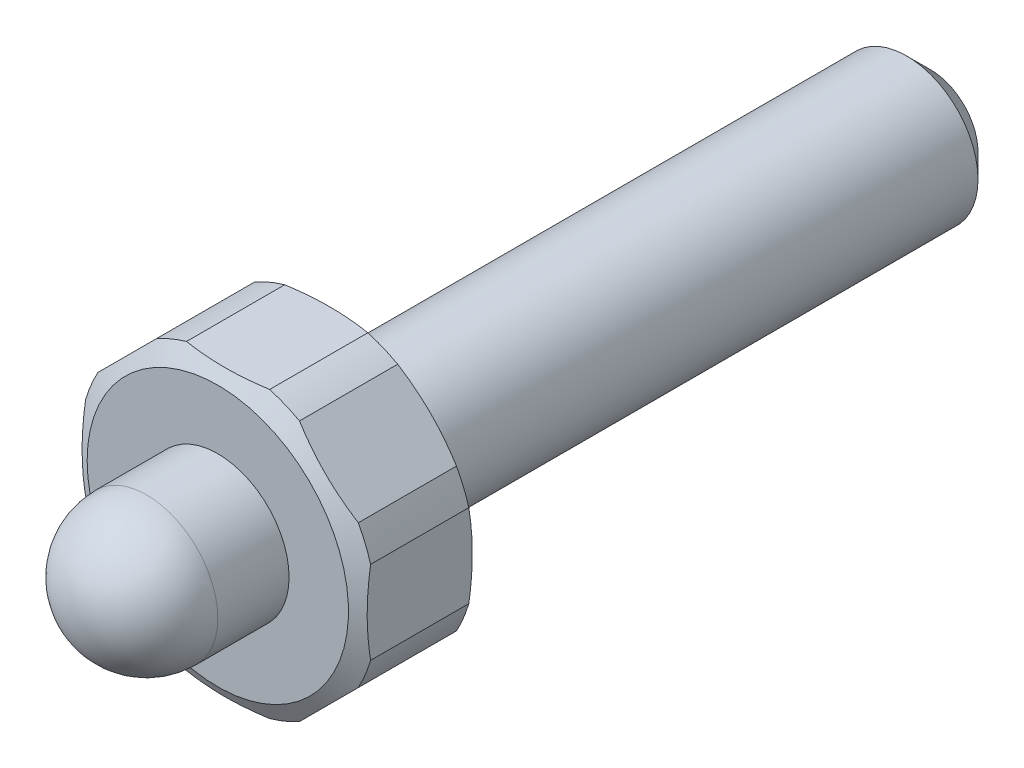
ISO-10303-21;
HEADER;
FILE_DESCRIPTION(('STEP AP214'),'2;1');
FILE_NAME('part.step','',(''),(''),'','','');
FILE_SCHEMA(('AUTOMOTIVE_DESIGN { 1 0 10303 214 1 1 1 1 }'));
ENDSEC;
DATA;
#1=APPLICATION_CONTEXT('core data for automotive mechanical design processes');
#2=APPLICATION_PROTOCOL_DEFINITION('international standard','automotive_design',2000,#1);
#3=PRODUCT_CONTEXT('',#1,'mechanical');
#4=PRODUCT('Part','Part','',(#3));
#5=PRODUCT_RELATED_PRODUCT_CATEGORY('part','',(#4));
#6=PRODUCT_DEFINITION_FORMATION('','',#4);
#7=PRODUCT_DEFINITION_CONTEXT('part definition',#1,'design');
#8=PRODUCT_DEFINITION('design','',#6,#7);
#9=PRODUCT_DEFINITION_SHAPE('','',#8);
#10=(LENGTH_UNIT() NAMED_UNIT(*) SI_UNIT(.MILLI.,.METRE.));
#11=(NAMED_UNIT(*) PLANE_ANGLE_UNIT() SI_UNIT($,.RADIAN.));
#12=(NAMED_UNIT(*) SI_UNIT($,.STERADIAN.) SOLID_ANGLE_UNIT());
#13=UNCERTAINTY_MEASURE_WITH_UNIT(LENGTH_MEASURE(1.E-05),#10,'distance_accuracy_value','');
#14=(GEOMETRIC_REPRESENTATION_CONTEXT(3) GLOBAL_UNCERTAINTY_ASSIGNED_CONTEXT((#13)) GLOBAL_UNIT_ASSIGNED_CONTEXT((#10,
#11,#12)) REPRESENTATION_CONTEXT('',''));
#15=CARTESIAN_POINT('',(0.,0.,0.));
#16=DIRECTION('',(0.,0.,1.));
#17=DIRECTION('',(1.,0.,0.));
#18=AXIS2_PLACEMENT_3D('',#15,#16,#17);
#19=CARTESIAN_POINT('',(-12.,4.97056274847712,60.));
#20=DIRECTION('',(-0.707106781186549,0.707106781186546,0.));
#21=DIRECTION('',(-0.707106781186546,-0.707106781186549,0.));
#22=AXIS2_PLACEMENT_3D('',#19,#20,#21);
#23=PLANE('',#22);
#24=CARTESIAN_POINT('',(-10.9603551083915,6.01020764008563,50.8660711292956));
#25=CARTESIAN_POINT('',(-10.7551775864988,6.21538516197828,50.8191285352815));
#26=CARTESIAN_POINT('',(-10.5493749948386,6.42118775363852,50.7774794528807));
#27=CARTESIAN_POINT('',(-10.1367512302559,6.8338115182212,50.7054403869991));
#28=CARTESIAN_POINT('',(-9.92992987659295,7.04063287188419,50.6750524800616));
#29=CARTESIAN_POINT('',(-9.51697288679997,7.45358986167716,50.6263902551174));
#30=CARTESIAN_POINT('',(-9.31084202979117,7.65972071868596,50.608035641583));
#31=CARTESIAN_POINT('',(-8.89823455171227,8.07232819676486,50.5835161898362));
#32=CARTESIAN_POINT('',(-8.69175796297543,8.2788047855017,50.5773502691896));
#33=CARTESIAN_POINT('',(-8.27880478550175,8.69175796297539,50.5773502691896));
#34=CARTESIAN_POINT('',(-8.07232819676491,8.89823455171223,50.5835161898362));
#35=CARTESIAN_POINT('',(-7.65972071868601,9.31084202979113,50.608035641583));
#36=CARTESIAN_POINT('',(-7.45358986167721,9.51697288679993,50.6263902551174));
#37=CARTESIAN_POINT('',(-7.04063287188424,9.92992987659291,50.6750524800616));
#38=CARTESIAN_POINT('',(-6.83381151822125,10.1367512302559,50.7054403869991));
#39=CARTESIAN_POINT('',(-6.42118775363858,10.5493749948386,50.7774794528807));
#40=CARTESIAN_POINT('',(-6.21538516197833,10.7551775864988,50.8191285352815));
#41=CARTESIAN_POINT('',(-6.01020764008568,10.9603551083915,50.8660711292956));
#42=B_SPLINE_CURVE_WITH_KNOTS('',3,(#24,#25,#26,#27,#28,#29,#30,#31,#32,#33,#34,#35,#36,#37,#38,
#39,#40,#41),.UNSPECIFIED.,.F.,.F.,(4,2,2,2,2,2,2,2,4),(0.,0.881804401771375,1.76377132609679,
2.63979150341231,3.515733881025,4.3916762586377,5.26769643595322,6.14966336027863,
7.03146776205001),.UNSPECIFIED.);
#43=CARTESIAN_POINT('',(-10.9601551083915,6.01040764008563,50.8660254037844));
#44=VERTEX_POINT('',#43);
#45=CARTESIAN_POINT('',(-6.01040764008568,10.9601551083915,50.8660254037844));
#46=VERTEX_POINT('',#45);
#47=EDGE_CURVE('E210',#44,#46,#42,.T.);
#48=ORIENTED_EDGE('',*,*,#47,.F.);
#49=DIRECTION('',(0.,0.,-1.));
#50=VECTOR('',#49,1.);
#51=CARTESIAN_POINT('',(-10.9601551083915,6.01040764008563,21.930889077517));
#52=LINE('',#51,#50);
#53=CARTESIAN_POINT('',(-10.9601551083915,6.01040764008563,59.1339745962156));
#54=VERTEX_POINT('',#53);
#55=EDGE_CURVE('E311',#54,#44,#52,.T.);
#56=ORIENTED_EDGE('',*,*,#55,.F.);
#57=CARTESIAN_POINT('',(-6.01020764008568,10.9603551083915,59.1339288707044));
#58=CARTESIAN_POINT('',(-6.21538516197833,10.7551775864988,59.1808714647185));
#59=CARTESIAN_POINT('',(-6.42118775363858,10.5493749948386,59.2225205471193));
#60=CARTESIAN_POINT('',(-6.83381151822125,10.1367512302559,59.2945596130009));
#61=CARTESIAN_POINT('',(-7.04063287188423,9.92992987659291,59.3249475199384));
#62=CARTESIAN_POINT('',(-7.45358986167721,9.51697288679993,59.3736097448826));
#63=CARTESIAN_POINT('',(-7.65972071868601,9.31084202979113,59.391964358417));
#64=CARTESIAN_POINT('',(-8.07232819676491,8.89823455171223,59.4164838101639));
#65=CARTESIAN_POINT('',(-8.27880478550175,8.69175796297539,59.4226497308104));
#66=CARTESIAN_POINT('',(-8.69175796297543,8.2788047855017,59.4226497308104));
#67=CARTESIAN_POINT('',(-8.89823455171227,8.07232819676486,59.4164838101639));
#68=CARTESIAN_POINT('',(-9.31084202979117,7.65972071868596,59.391964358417));
#69=CARTESIAN_POINT('',(-9.51697288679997,7.45358986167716,59.3736097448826));
#70=CARTESIAN_POINT('',(-9.92992987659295,7.04063287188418,59.3249475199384));
#71=CARTESIAN_POINT('',(-10.1367512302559,6.8338115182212,59.2945596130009));
#72=CARTESIAN_POINT('',(-10.5493749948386,6.42118775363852,59.2225205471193));
#73=CARTESIAN_POINT('',(-10.7551775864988,6.21538516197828,59.1808714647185));
#74=CARTESIAN_POINT('',(-10.9603551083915,6.01020764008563,59.1339288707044));
#75=B_SPLINE_CURVE_WITH_KNOTS('',3,(#57,#58,#59,#60,#61,#62,#63,#64,#65,#66,#67,#68,#69,#70,#71,
#72,#73,#74),.UNSPECIFIED.,.F.,.F.,(4,2,2,2,2,2,2,2,4),(0.,0.881804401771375,1.76377132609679,
2.63979150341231,3.51573388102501,4.3916762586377,5.26769643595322,6.14966336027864,
7.03146776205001),.UNSPECIFIED.);
#76=CARTESIAN_POINT('',(-6.01040764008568,10.9601551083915,59.1339745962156));
#77=VERTEX_POINT('',#76);
#78=EDGE_CURVE('E202',#77,#54,#75,.T.);
#79=ORIENTED_EDGE('',*,*,#78,.F.);
#80=DIRECTION('',(0.,0.,-1.));
#81=VECTOR('',#80,1.);
#82=CARTESIAN_POINT('',(-6.01040764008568,10.9601551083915,21.930889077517));
#83=LINE('',#82,#81);
#84=EDGE_CURVE('E317',#46,#77,#83,.F.);
#85=ORIENTED_EDGE('',*,*,#84,.F.);
#86=EDGE_LOOP('',(#48,#56,#79,#85));
#87=FACE_BOUND('',#86,.T.);
#88=ADVANCED_FACE('F14',(#87),#23,.T.);
#89=CARTESIAN_POINT('',(-12.,4.97056274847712,60.));
#90=DIRECTION('',(1.,0.,0.));
#91=DIRECTION('',(0.,1.,0.));
#92=AXIS2_PLACEMENT_3D('',#89,#90,#91);
#93=PLANE('',#92);
#94=DIRECTION('',(0.,0.,-1.));
#95=VECTOR('',#94,1.);
#96=CARTESIAN_POINT('',(-12.,3.5,21.930889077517));
#97=LINE('',#96,#95);
#98=CARTESIAN_POINT('',(-12.,3.5,59.1339745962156));
#99=VERTEX_POINT('',#98);
#100=CARTESIAN_POINT('',(-12.,3.5,50.8660254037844));
#101=VERTEX_POINT('',#100);
#102=EDGE_CURVE('E134',#99,#101,#97,.T.);
#103=ORIENTED_EDGE('',*,*,#102,.T.);
#104=CARTESIAN_POINT('',(-12.,-12.7979864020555,53.7781228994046));
#105=CARTESIAN_POINT('',(-12.,-12.5935697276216,53.6920315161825));
#106=CARTESIAN_POINT('',(-12.,-12.3888099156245,53.6067557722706));
#107=CARTESIAN_POINT('',(-12.,-11.9785470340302,53.4379986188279));
#108=CARTESIAN_POINT('',(-12.,-11.7730439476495,53.3545172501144));
#109=CARTESIAN_POINT('',(-12.,-11.1552376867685,53.1069708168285));
#110=CARTESIAN_POINT('',(-12.,-10.7417472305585,52.945849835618));
#111=CARTESIAN_POINT('',(-12.,-9.90890144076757,52.6322079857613));
#112=CARTESIAN_POINT('',(-12.,-9.48952634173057,52.47973942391));
#113=CARTESIAN_POINT('',(-12.,-8.6467566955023,52.1863866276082));
#114=CARTESIAN_POINT('',(-12.,-8.22336245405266,52.0455015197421));
#115=CARTESIAN_POINT('',(-12.,-7.37949727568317,51.7800346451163));
#116=CARTESIAN_POINT('',(-12.,-6.95910217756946,51.6552132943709));
#117=CARTESIAN_POINT('',(-12.,-6.11377888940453,51.4217606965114));
#118=CARTESIAN_POINT('',(-12.,-5.68885047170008,51.3131302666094));
#119=CARTESIAN_POINT('',(-12.,-4.83538927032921,51.1152620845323));
#120=CARTESIAN_POINT('',(-12.,-4.40686575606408,51.02598469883));
#121=CARTESIAN_POINT('',(-12.,-3.5457963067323,50.8696245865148));
#122=CARTESIAN_POINT('',(-12.,-3.11325111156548,50.8025378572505));
#123=CARTESIAN_POINT('',(-12.,-2.40288278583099,50.713164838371));
#124=CARTESIAN_POINT('',(-12.,-2.12598112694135,50.683458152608));
#125=CARTESIAN_POINT('',(-12.,-1.57124715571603,50.6346968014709));
#126=CARTESIAN_POINT('',(-12.,-1.29341490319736,50.6156414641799));
#127=CARTESIAN_POINT('',(-12.,-0.737154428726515,50.5885651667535));
#128=CARTESIAN_POINT('',(-12.,-0.458726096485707,50.5805464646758));
#129=CARTESIAN_POINT('',(-12.,0.0982318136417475,50.5757171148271));
#130=CARTESIAN_POINT('',(-12.,0.376761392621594,50.5789065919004));
#131=CARTESIAN_POINT('',(-12.,0.93458074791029,50.5964623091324));
#132=CARTESIAN_POINT('',(-12.,1.21386911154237,50.6108731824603));
#133=CARTESIAN_POINT('',(-12.,1.7716598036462,50.6506271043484));
#134=CARTESIAN_POINT('',(-12.,2.05016213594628,50.6759700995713));
#135=CARTESIAN_POINT('',(-12.,2.60594437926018,50.7370837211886));
#136=CARTESIAN_POINT('',(-12.,2.88322458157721,50.7728517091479));
#137=CARTESIAN_POINT('',(-12.,3.4363685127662,50.8541694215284));
#138=CARTESIAN_POINT('',(-12.,3.71223204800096,50.8997204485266));
#139=CARTESIAN_POINT('',(-12.,4.59131621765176,51.0597657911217));
#140=CARTESIAN_POINT('',(-12.,5.19143166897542,51.1915563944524));
#141=CARTESIAN_POINT('',(-12.,6.38280029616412,51.4903094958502));
#142=CARTESIAN_POINT('',(-12.,6.97405057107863,51.6572832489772));
#143=CARTESIAN_POINT('',(-12.,8.1500167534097,52.0192220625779));
#144=CARTESIAN_POINT('',(-12.,8.73470381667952,52.2142798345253));
#145=CARTESIAN_POINT('',(-12.,9.89640688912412,52.6255676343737));
#146=CARTESIAN_POINT('',(-12.,10.4734240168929,52.8417945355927));
#147=CARTESIAN_POINT('',(-12.,11.6202233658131,53.290239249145));
#148=CARTESIAN_POINT('',(-12.,12.1900146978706,53.5224339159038));
#149=CARTESIAN_POINT('',(-12.,13.3243078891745,53.9994491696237));
#150=CARTESIAN_POINT('',(-12.,13.8888093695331,54.2442706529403));
#151=CARTESIAN_POINT('',(-12.,15.0087351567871,54.7417163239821));
#152=CARTESIAN_POINT('',(-12.,15.5641959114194,54.9942587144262));
#153=CARTESIAN_POINT('',(-12.,16.3946287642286,55.3788335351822));
#154=CARTESIAN_POINT('',(-12.,16.6709482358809,55.5079700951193));
#155=CARTESIAN_POINT('',(-12.,17.2227649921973,55.7679788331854));
#156=CARTESIAN_POINT('',(-12.,17.4982622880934,55.89885098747));
#157=CARTESIAN_POINT('',(-12.,17.773390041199,56.0304958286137));
#158=B_SPLINE_CURVE_WITH_KNOTS('',3,(#104,#105,#106,#107,#108,#109,#110,#111,#112,#113,#114,
#115,#116,#117,#118,#119,#120,#121,#122,#123,#124,#125,#126,#127,#128,#129,#130,#131,#132,#133,
#134,#135,#136,#137,#138,#139,#140,#141,#142,#143,#144,#145,#146,#147,#148,#149,#150,#151,#152,
#153,#154,#155,#156,#157),.UNSPECIFIED.,.F.,.F.,(4,2,2,2,2,2,2,2,2,2,2,2,2,2,2,2,2,2,2,2,2,2,2,
2,2,2,4),(0.,0.665414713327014,1.33084454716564,2.66206155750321,4.00061723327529,
5.33907188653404,6.65440619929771,7.96980687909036,9.2824877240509,10.594931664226,
11.430221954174,12.2654595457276,13.1008679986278,13.936285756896,14.7750434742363,
15.6137970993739,16.4523386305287,17.2909918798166,19.1327366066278,20.9750714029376,
22.8236338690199,24.6719237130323,26.5175887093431,28.3633849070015,30.1938347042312,
31.1088481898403,32.0238491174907),.UNSPECIFIED.);
#159=CARTESIAN_POINT('',(-12.,-3.5,50.8660254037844));
#160=VERTEX_POINT('',#159);
#161=EDGE_CURVE('E126',#101,#160,#158,.F.);
#162=ORIENTED_EDGE('',*,*,#161,.T.);
#163=DIRECTION('',(0.,0.,-1.));
#164=VECTOR('',#163,1.);
#165=CARTESIAN_POINT('',(-12.,-3.5,21.930889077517));
#166=LINE('',#165,#164);
#167=CARTESIAN_POINT('',(-12.,-3.5,59.1339745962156));
#168=VERTEX_POINT('',#167);
#169=EDGE_CURVE('E36',#160,#168,#166,.F.);
#170=ORIENTED_EDGE('',*,*,#169,.T.);
#171=CARTESIAN_POINT('',(-12.,-12.7979864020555,56.2218771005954));
#172=CARTESIAN_POINT('',(-12.,-12.5935697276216,56.3079684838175));
#173=CARTESIAN_POINT('',(-12.,-12.3888099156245,56.3932442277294));
#174=CARTESIAN_POINT('',(-12.,-11.9785470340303,56.5620013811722));
#175=CARTESIAN_POINT('',(-12.,-11.7730439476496,56.6454827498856));
#176=CARTESIAN_POINT('',(-12.,-11.1552376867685,56.8930291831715));
#177=CARTESIAN_POINT('',(-12.,-10.7417472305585,57.0541501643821));
#178=CARTESIAN_POINT('',(-12.,-9.90890144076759,57.3677920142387));
#179=CARTESIAN_POINT('',(-12.,-9.48952634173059,57.5202605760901));
#180=CARTESIAN_POINT('',(-12.,-8.64675669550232,57.8136133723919));
#181=CARTESIAN_POINT('',(-12.,-8.22336245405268,57.9544984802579));
#182=CARTESIAN_POINT('',(-12.,-7.37949727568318,58.2199653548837));
#183=CARTESIAN_POINT('',(-12.,-6.95910217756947,58.3447867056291));
#184=CARTESIAN_POINT('',(-12.,-6.11377888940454,58.5782393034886));
#185=CARTESIAN_POINT('',(-12.,-5.68885047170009,58.6868697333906));
#186=CARTESIAN_POINT('',(-12.,-4.83538927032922,58.8847379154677));
#187=CARTESIAN_POINT('',(-12.,-4.40686575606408,58.97401530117));
#188=CARTESIAN_POINT('',(-12.,-3.5457963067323,59.1303754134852));
#189=CARTESIAN_POINT('',(-12.,-3.11325111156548,59.1974621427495));
#190=CARTESIAN_POINT('',(-12.,-2.40288278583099,59.286835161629));
#191=CARTESIAN_POINT('',(-12.,-2.12598112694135,59.316541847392));
#192=CARTESIAN_POINT('',(-12.,-1.57124715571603,59.3653031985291));
#193=CARTESIAN_POINT('',(-12.,-1.29341490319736,59.3843585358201));
#194=CARTESIAN_POINT('',(-12.,-0.737154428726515,59.4114348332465));
#195=CARTESIAN_POINT('',(-12.,-0.458726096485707,59.4194535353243));
#196=CARTESIAN_POINT('',(-12.,0.0982318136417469,59.4242828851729));
#197=CARTESIAN_POINT('',(-12.,0.376761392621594,59.4210934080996));
#198=CARTESIAN_POINT('',(-12.,0.934580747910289,59.4035376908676));
#199=CARTESIAN_POINT('',(-12.,1.21386911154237,59.3891268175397));
#200=CARTESIAN_POINT('',(-12.,1.7716598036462,59.3493728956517));
#201=CARTESIAN_POINT('',(-12.,2.05016213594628,59.3240299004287));
#202=CARTESIAN_POINT('',(-12.,2.60594437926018,59.2629162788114));
#203=CARTESIAN_POINT('',(-12.,2.88322458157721,59.2271482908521));
#204=CARTESIAN_POINT('',(-12.,3.4363685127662,59.1458305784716));
#205=CARTESIAN_POINT('',(-12.,3.71223204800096,59.1002795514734));
#206=CARTESIAN_POINT('',(-12.,4.59131621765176,58.9402342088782));
#207=CARTESIAN_POINT('',(-12.,5.19143166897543,58.8084436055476));
#208=CARTESIAN_POINT('',(-12.,6.38280029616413,58.5096905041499));
#209=CARTESIAN_POINT('',(-12.,6.97405057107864,58.3427167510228));
#210=CARTESIAN_POINT('',(-12.,8.15001675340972,57.9807779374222));
#211=CARTESIAN_POINT('',(-12.,8.73470381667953,57.7857201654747));
#212=CARTESIAN_POINT('',(-12.,9.89640688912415,57.3744323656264));
#213=CARTESIAN_POINT('',(-12.,10.4734240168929,57.1582054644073));
#214=CARTESIAN_POINT('',(-12.,11.6202233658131,56.709760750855));
#215=CARTESIAN_POINT('',(-12.,12.1900146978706,56.4775660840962));
#216=CARTESIAN_POINT('',(-12.,13.3243078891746,56.0005508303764));
#217=CARTESIAN_POINT('',(-12.,13.8888093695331,55.7557293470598));
#218=CARTESIAN_POINT('',(-12.,15.0087351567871,55.258283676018));
#219=CARTESIAN_POINT('',(-12.,15.5641959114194,55.0057412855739));
#220=CARTESIAN_POINT('',(-12.,16.3946287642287,54.6211664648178));
#221=CARTESIAN_POINT('',(-12.,16.6709482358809,54.4920299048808));
#222=CARTESIAN_POINT('',(-12.,17.2227649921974,54.2320211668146));
#223=CARTESIAN_POINT('',(-12.,17.4982622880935,54.10114901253));
#224=CARTESIAN_POINT('',(-12.,17.773390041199,53.9695041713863));
#225=B_SPLINE_CURVE_WITH_KNOTS('',3,(#171,#172,#173,#174,#175,#176,#177,#178,#179,#180,#181,
#182,#183,#184,#185,#186,#187,#188,#189,#190,#191,#192,#193,#194,#195,#196,#197,#198,#199,#200,
#201,#202,#203,#204,#205,#206,#207,#208,#209,#210,#211,#212,#213,#214,#215,#216,#217,#218,#219,
#220,#221,#222,#223,#224),.UNSPECIFIED.,.F.,.F.,(4,2,2,2,2,2,2,2,2,2,2,2,2,2,2,2,2,2,2,2,2,2,2,
2,2,2,4),(0.,0.665414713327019,1.33084454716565,2.66206155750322,4.0006172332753,
5.33907188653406,6.65440619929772,7.96980687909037,9.28248772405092,10.594931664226,
11.430221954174,12.2654595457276,13.1008679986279,13.936285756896,14.7750434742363,
15.6137970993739,16.4523386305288,17.2909918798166,19.1327366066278,20.9750714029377,
22.82363386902,24.6719237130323,26.5175887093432,28.3633849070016,30.1938347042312,
31.1088481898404,32.0238491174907),.UNSPECIFIED.);
#226=EDGE_CURVE('E353',#168,#99,#225,.T.);
#227=ORIENTED_EDGE('',*,*,#226,.T.);
#228=EDGE_LOOP('',(#103,#162,#170,#227));
#229=FACE_BOUND('',#228,.T.);
#230=ADVANCED_FACE('F132',(#229),#93,.F.);
#231=CARTESIAN_POINT('',(-12.,-4.97056274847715,60.));
#232=DIRECTION('',(0.707106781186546,0.707106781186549,0.));
#233=DIRECTION('',(-0.707106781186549,0.707106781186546,0.));
#234=AXIS2_PLACEMENT_3D('',#231,#232,#233);
#235=PLANE('',#234);
#236=DIRECTION('',(0.,0.,-1.));
#237=VECTOR('',#236,1.);
#238=CARTESIAN_POINT('',(-10.9601551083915,-6.01040764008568,21.930889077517));
#239=LINE('',#238,#237);
#240=CARTESIAN_POINT('',(-10.9601551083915,-6.01040764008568,59.1339745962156));
#241=VERTEX_POINT('',#240);
#242=CARTESIAN_POINT('',(-10.9601551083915,-6.01040764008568,50.8660254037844));
#243=VERTEX_POINT('',#242);
#244=EDGE_CURVE('E140',#241,#243,#239,.T.);
#245=ORIENTED_EDGE('',*,*,#244,.T.);
#246=CARTESIAN_POINT('',(-10.9603551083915,-6.01020764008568,50.8660711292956));
#247=CARTESIAN_POINT('',(-10.7551775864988,-6.21538516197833,50.8191285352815));
#248=CARTESIAN_POINT('',(-10.5493749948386,-6.42118775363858,50.7774794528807));
#249=CARTESIAN_POINT('',(-10.1367512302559,-6.83381151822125,50.7054403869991));
#250=CARTESIAN_POINT('',(-9.92992987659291,-7.04063287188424,50.6750524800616));
#251=CARTESIAN_POINT('',(-9.51697288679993,-7.45358986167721,50.6263902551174));
#252=CARTESIAN_POINT('',(-9.31084202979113,-7.65972071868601,50.608035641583));
#253=CARTESIAN_POINT('',(-8.89823455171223,-8.07232819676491,50.5835161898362));
#254=CARTESIAN_POINT('',(-8.69175796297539,-8.27880478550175,50.5773502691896));
#255=CARTESIAN_POINT('',(-8.2788047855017,-8.69175796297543,50.5773502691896));
#256=CARTESIAN_POINT('',(-8.07232819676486,-8.89823455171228,50.5835161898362));
#257=CARTESIAN_POINT('',(-7.65972071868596,-9.31084202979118,50.608035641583));
#258=CARTESIAN_POINT('',(-7.45358986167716,-9.51697288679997,50.6263902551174));
#259=CARTESIAN_POINT('',(-7.04063287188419,-9.92992987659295,50.6750524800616));
#260=CARTESIAN_POINT('',(-6.8338115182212,-10.1367512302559,50.7054403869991));
#261=CARTESIAN_POINT('',(-6.42118775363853,-10.5493749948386,50.7774794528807));
#262=CARTESIAN_POINT('',(-6.21538516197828,-10.7551775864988,50.8191285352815));
#263=CARTESIAN_POINT('',(-6.01020764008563,-10.9603551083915,50.8660711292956));
#264=B_SPLINE_CURVE_WITH_KNOTS('',3,(#246,#247,#248,#249,#250,#251,#252,#253,#254,#255,#256,
#257,#258,#259,#260,#261,#262,#263),.UNSPECIFIED.,.F.,.F.,(4,2,2,2,2,2,2,2,4),(0.,
0.881804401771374,1.76377132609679,2.63979150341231,3.515733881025,4.3916762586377,
5.26769643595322,6.14966336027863,7.03146776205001),.UNSPECIFIED.);
#265=CARTESIAN_POINT('',(-6.01040764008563,-10.9601551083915,50.8660254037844));
#266=VERTEX_POINT('',#265);
#267=EDGE_CURVE('E29',#243,#266,#264,.T.);
#268=ORIENTED_EDGE('',*,*,#267,.T.);
#269=DIRECTION('',(0.,0.,-1.));
#270=VECTOR('',#269,1.);
#271=CARTESIAN_POINT('',(-6.01040764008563,-10.9601551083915,21.930889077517));
#272=LINE('',#271,#270);
#273=CARTESIAN_POINT('',(-6.01040764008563,-10.9601551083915,59.1339745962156));
#274=VERTEX_POINT('',#273);
#275=EDGE_CURVE('E145',#266,#274,#272,.F.);
#276=ORIENTED_EDGE('',*,*,#275,.T.);
#277=CARTESIAN_POINT('',(-6.01020764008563,-10.9603551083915,59.1339288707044));
#278=CARTESIAN_POINT('',(-6.21538516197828,-10.7551775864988,59.1808714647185));
#279=CARTESIAN_POINT('',(-6.42118775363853,-10.5493749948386,59.2225205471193));
#280=CARTESIAN_POINT('',(-6.8338115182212,-10.1367512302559,59.2945596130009));
#281=CARTESIAN_POINT('',(-7.04063287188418,-9.92992987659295,59.3249475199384));
#282=CARTESIAN_POINT('',(-7.45358986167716,-9.51697288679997,59.3736097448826));
#283=CARTESIAN_POINT('',(-7.65972071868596,-9.31084202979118,59.391964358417));
#284=CARTESIAN_POINT('',(-8.07232819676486,-8.89823455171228,59.4164838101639));
#285=CARTESIAN_POINT('',(-8.2788047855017,-8.69175796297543,59.4226497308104));
#286=CARTESIAN_POINT('',(-8.69175796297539,-8.27880478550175,59.4226497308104));
#287=CARTESIAN_POINT('',(-8.89823455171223,-8.07232819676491,59.4164838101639));
#288=CARTESIAN_POINT('',(-9.31084202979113,-7.65972071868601,59.391964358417));
#289=CARTESIAN_POINT('',(-9.51697288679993,-7.45358986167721,59.3736097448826));
#290=CARTESIAN_POINT('',(-9.92992987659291,-7.04063287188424,59.3249475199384));
#291=CARTESIAN_POINT('',(-10.1367512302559,-6.83381151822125,59.2945596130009));
#292=CARTESIAN_POINT('',(-10.5493749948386,-6.42118775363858,59.2225205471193));
#293=CARTESIAN_POINT('',(-10.7551775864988,-6.21538516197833,59.1808714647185));
#294=CARTESIAN_POINT('',(-10.9603551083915,-6.01020764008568,59.1339288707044));
#295=B_SPLINE_CURVE_WITH_KNOTS('',3,(#277,#278,#279,#280,#281,#282,#283,#284,#285,#286,#287,
#288,#289,#290,#291,#292,#293,#294),.UNSPECIFIED.,.F.,.F.,(4,2,2,2,2,2,2,2,4),(0.,
0.881804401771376,1.76377132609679,2.63979150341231,3.51573388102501,4.3916762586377,
5.26769643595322,6.14966336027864,7.03146776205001),.UNSPECIFIED.);
#296=EDGE_CURVE('E344',#274,#241,#295,.T.);
#297=ORIENTED_EDGE('',*,*,#296,.T.);
#298=EDGE_LOOP('',(#245,#268,#276,#297));
#299=FACE_BOUND('',#298,.T.);
#300=ADVANCED_FACE('F190',(#299),#235,.F.);
#301=CARTESIAN_POINT('',(4.97056274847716,-12.,60.));
#302=DIRECTION('',(0.,-1.,0.));
#303=DIRECTION('',(0.,0.,-1.));
#304=AXIS2_PLACEMENT_3D('',#301,#302,#303);
#305=PLANE('',#304);
#306=CARTESIAN_POINT('',(-12.7979864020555,-12.,53.7781228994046));
#307=CARTESIAN_POINT('',(-12.5935697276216,-12.,53.6920315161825));
#308=CARTESIAN_POINT('',(-12.3888099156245,-12.,53.6067557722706));
#309=CARTESIAN_POINT('',(-11.9785470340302,-12.,53.4379986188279));
#310=CARTESIAN_POINT('',(-11.7730439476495,-12.,53.3545172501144));
#311=CARTESIAN_POINT('',(-11.1552376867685,-12.,53.1069708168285));
#312=CARTESIAN_POINT('',(-10.7417472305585,-12.,52.945849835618));
#313=CARTESIAN_POINT('',(-9.90890144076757,-12.,52.6322079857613));
#314=CARTESIAN_POINT('',(-9.48952634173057,-12.,52.47973942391));
#315=CARTESIAN_POINT('',(-8.6467566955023,-12.,52.1863866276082));
#316=CARTESIAN_POINT('',(-8.22336245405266,-12.,52.0455015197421));
#317=CARTESIAN_POINT('',(-7.37949727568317,-12.,51.7800346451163));
#318=CARTESIAN_POINT('',(-6.95910217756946,-12.,51.6552132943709));
#319=CARTESIAN_POINT('',(-6.11377888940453,-12.,51.4217606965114));
#320=CARTESIAN_POINT('',(-5.68885047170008,-12.,51.3131302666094));
#321=CARTESIAN_POINT('',(-4.83538927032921,-12.,51.1152620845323));
#322=CARTESIAN_POINT('',(-4.40686575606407,-12.,51.02598469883));
#323=CARTESIAN_POINT('',(-3.54579630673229,-12.,50.8696245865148));
#324=CARTESIAN_POINT('',(-3.11325111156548,-12.,50.8025378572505));
#325=CARTESIAN_POINT('',(-2.40288278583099,-12.,50.713164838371));
#326=CARTESIAN_POINT('',(-2.12598112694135,-12.,50.683458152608));
#327=CARTESIAN_POINT('',(-1.57124715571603,-12.,50.6346968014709));
#328=CARTESIAN_POINT('',(-1.29341490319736,-12.,50.6156414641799));
#329=CARTESIAN_POINT('',(-0.737154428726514,-12.,50.5885651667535));
#330=CARTESIAN_POINT('',(-0.458726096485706,-12.,50.5805464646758));
#331=CARTESIAN_POINT('',(0.0982318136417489,-12.,50.5757171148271));
#332=CARTESIAN_POINT('',(0.376761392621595,-12.,50.5789065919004));
#333=CARTESIAN_POINT('',(0.93458074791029,-12.,50.5964623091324));
#334=CARTESIAN_POINT('',(1.21386911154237,-12.,50.6108731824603));
#335=CARTESIAN_POINT('',(1.7716598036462,-12.,50.6506271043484));
#336=CARTESIAN_POINT('',(2.05016213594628,-12.,50.6759700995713));
#337=CARTESIAN_POINT('',(2.60594437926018,-12.,50.7370837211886));
#338=CARTESIAN_POINT('',(2.88322458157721,-12.,50.7728517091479));
#339=CARTESIAN_POINT('',(3.4363685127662,-12.,50.8541694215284));
#340=CARTESIAN_POINT('',(3.71223204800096,-12.,50.8997204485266));
#341=CARTESIAN_POINT('',(4.59131621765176,-12.,51.0597657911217));
#342=CARTESIAN_POINT('',(5.19143166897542,-12.,51.1915563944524));
#343=CARTESIAN_POINT('',(6.38280029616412,-12.,51.4903094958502));
#344=CARTESIAN_POINT('',(6.97405057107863,-12.,51.6572832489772));
#345=CARTESIAN_POINT('',(8.1500167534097,-12.,52.0192220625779));
#346=CARTESIAN_POINT('',(8.73470381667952,-12.,52.2142798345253));
#347=CARTESIAN_POINT('',(9.89640688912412,-12.,52.6255676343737));
#348=CARTESIAN_POINT('',(10.4734240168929,-12.,52.8417945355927));
#349=CARTESIAN_POINT('',(11.6202233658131,-12.,53.290239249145));
#350=CARTESIAN_POINT('',(12.1900146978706,-12.,53.5224339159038));
#351=CARTESIAN_POINT('',(13.3243078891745,-12.,53.9994491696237));
#352=CARTESIAN_POINT('',(13.8888093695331,-12.,54.2442706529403));
#353=CARTESIAN_POINT('',(15.0087351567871,-12.,54.7417163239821));
#354=CARTESIAN_POINT('',(15.5641959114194,-12.,54.9942587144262));
#355=CARTESIAN_POINT('',(16.3946287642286,-12.,55.3788335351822));
#356=CARTESIAN_POINT('',(16.6709482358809,-12.,55.5079700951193));
#357=CARTESIAN_POINT('',(17.2227649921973,-12.,55.7679788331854));
#358=CARTESIAN_POINT('',(17.4982622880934,-12.,55.89885098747));
#359=CARTESIAN_POINT('',(17.773390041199,-12.,56.0304958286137));
#360=B_SPLINE_CURVE_WITH_KNOTS('',3,(#306,#307,#308,#309,#310,#311,#312,#313,#314,#315,#316,
#317,#318,#319,#320,#321,#322,#323,#324,#325,#326,#327,#328,#329,#330,#331,#332,#333,#334,#335,
#336,#337,#338,#339,#340,#341,#342,#343,#344,#345,#346,#347,#348,#349,#350,#351,#352,#353,#354,
#355,#356,#357,#358,#359),.UNSPECIFIED.,.F.,.F.,(4,2,2,2,2,2,2,2,2,2,2,2,2,2,2,2,2,2,2,2,2,2,2,
2,2,2,4),(0.,0.665414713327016,1.33084454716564,2.66206155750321,4.00061723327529,
5.33907188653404,6.6544061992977,7.96980687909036,9.2824877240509,10.594931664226,
11.430221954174,12.2654595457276,13.1008679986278,13.936285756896,14.7750434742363,
15.6137970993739,16.4523386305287,17.2909918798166,19.1327366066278,20.9750714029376,
22.8236338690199,24.6719237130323,26.5175887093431,28.3633849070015,30.1938347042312,
31.1088481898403,32.0238491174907),.UNSPECIFIED.);
#361=CARTESIAN_POINT('',(3.5,-12.,50.8660254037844));
#362=VERTEX_POINT('',#361);
#363=CARTESIAN_POINT('',(-3.5,-12.,50.8660254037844));
#364=VERTEX_POINT('',#363);
#365=EDGE_CURVE('E219',#362,#364,#360,.F.);
#366=ORIENTED_EDGE('',*,*,#365,.F.);
#367=DIRECTION('',(0.,0.,-1.));
#368=VECTOR('',#367,1.);
#369=CARTESIAN_POINT('',(3.5,-12.,21.930889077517));
#370=LINE('',#369,#368);
#371=CARTESIAN_POINT('',(3.5,-12.,59.1339745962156));
#372=VERTEX_POINT('',#371);
#373=EDGE_CURVE('E336',#372,#362,#370,.T.);
#374=ORIENTED_EDGE('',*,*,#373,.F.);
#375=CARTESIAN_POINT('',(-12.7979864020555,-12.,56.2218771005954));
#376=CARTESIAN_POINT('',(-12.5935697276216,-12.,56.3079684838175));
#377=CARTESIAN_POINT('',(-12.3888099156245,-12.,56.3932442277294));
#378=CARTESIAN_POINT('',(-11.9785470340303,-12.,56.5620013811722));
#379=CARTESIAN_POINT('',(-11.7730439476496,-12.,56.6454827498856));
#380=CARTESIAN_POINT('',(-11.1552376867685,-12.,56.8930291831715));
#381=CARTESIAN_POINT('',(-10.7417472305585,-12.,57.0541501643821));
#382=CARTESIAN_POINT('',(-9.90890144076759,-12.,57.3677920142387));
#383=CARTESIAN_POINT('',(-9.48952634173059,-12.,57.5202605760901));
#384=CARTESIAN_POINT('',(-8.64675669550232,-12.,57.8136133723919));
#385=CARTESIAN_POINT('',(-8.22336245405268,-12.,57.9544984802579));
#386=CARTESIAN_POINT('',(-7.37949727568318,-12.,58.2199653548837));
#387=CARTESIAN_POINT('',(-6.95910217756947,-12.,58.3447867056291));
#388=CARTESIAN_POINT('',(-6.11377888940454,-12.,58.5782393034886));
#389=CARTESIAN_POINT('',(-5.68885047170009,-12.,58.6868697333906));
#390=CARTESIAN_POINT('',(-4.83538927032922,-12.,58.8847379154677));
#391=CARTESIAN_POINT('',(-4.40686575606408,-12.,58.97401530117));
#392=CARTESIAN_POINT('',(-3.5457963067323,-12.,59.1303754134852));
#393=CARTESIAN_POINT('',(-3.11325111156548,-12.,59.1974621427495));
#394=CARTESIAN_POINT('',(-2.40288278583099,-12.,59.286835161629));
#395=CARTESIAN_POINT('',(-2.12598112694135,-12.,59.316541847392));
#396=CARTESIAN_POINT('',(-1.57124715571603,-12.,59.3653031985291));
#397=CARTESIAN_POINT('',(-1.29341490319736,-12.,59.3843585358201));
#398=CARTESIAN_POINT('',(-0.737154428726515,-12.,59.4114348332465));
#399=CARTESIAN_POINT('',(-0.458726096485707,-12.,59.4194535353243));
#400=CARTESIAN_POINT('',(0.0982318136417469,-12.,59.4242828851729));
#401=CARTESIAN_POINT('',(0.376761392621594,-12.,59.4210934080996));
#402=CARTESIAN_POINT('',(0.934580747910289,-12.,59.4035376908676));
#403=CARTESIAN_POINT('',(1.21386911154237,-12.,59.3891268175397));
#404=CARTESIAN_POINT('',(1.7716598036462,-12.,59.3493728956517));
#405=CARTESIAN_POINT('',(2.05016213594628,-12.,59.3240299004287));
#406=CARTESIAN_POINT('',(2.60594437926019,-12.,59.2629162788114));
#407=CARTESIAN_POINT('',(2.88322458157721,-12.,59.2271482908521));
#408=CARTESIAN_POINT('',(3.4363685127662,-12.,59.1458305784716));
#409=CARTESIAN_POINT('',(3.71223204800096,-12.,59.1002795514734));
#410=CARTESIAN_POINT('',(4.59131621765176,-12.,58.9402342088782));
#411=CARTESIAN_POINT('',(5.19143166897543,-12.,58.8084436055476));
#412=CARTESIAN_POINT('',(6.38280029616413,-12.,58.5096905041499));
#413=CARTESIAN_POINT('',(6.97405057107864,-12.,58.3427167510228));
#414=CARTESIAN_POINT('',(8.15001675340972,-12.,57.9807779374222));
#415=CARTESIAN_POINT('',(8.73470381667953,-12.,57.7857201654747));
#416=CARTESIAN_POINT('',(9.89640688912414,-12.,57.3744323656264));
#417=CARTESIAN_POINT('',(10.4734240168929,-12.,57.1582054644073));
#418=CARTESIAN_POINT('',(11.6202233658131,-12.,56.709760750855));
#419=CARTESIAN_POINT('',(12.1900146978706,-12.,56.4775660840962));
#420=CARTESIAN_POINT('',(13.3243078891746,-12.,56.0005508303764));
#421=CARTESIAN_POINT('',(13.8888093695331,-12.,55.7557293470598));
#422=CARTESIAN_POINT('',(15.0087351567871,-12.,55.258283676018));
#423=CARTESIAN_POINT('',(15.5641959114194,-12.,55.0057412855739));
#424=CARTESIAN_POINT('',(16.3946287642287,-12.,54.6211664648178));
#425=CARTESIAN_POINT('',(16.6709482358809,-12.,54.4920299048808));
#426=CARTESIAN_POINT('',(17.2227649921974,-12.,54.2320211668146));
#427=CARTESIAN_POINT('',(17.4982622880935,-12.,54.10114901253));
#428=CARTESIAN_POINT('',(17.773390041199,-12.,53.9695041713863));
#429=B_SPLINE_CURVE_WITH_KNOTS('',3,(#375,#376,#377,#378,#379,#380,#381,#382,#383,#384,#385,
#386,#387,#388,#389,#390,#391,#392,#393,#394,#395,#396,#397,#398,#399,#400,#401,#402,#403,#404,
#405,#406,#407,#408,#409,#410,#411,#412,#413,#414,#415,#416,#417,#418,#419,#420,#421,#422,#423,
#424,#425,#426,#427,#428),.UNSPECIFIED.,.F.,.F.,(4,2,2,2,2,2,2,2,2,2,2,2,2,2,2,2,2,2,2,2,2,2,2,
2,2,2,4),(0.,0.665414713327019,1.33084454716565,2.66206155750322,4.0006172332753,
5.33907188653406,6.65440619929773,7.96980687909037,9.28248772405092,10.594931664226,
11.430221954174,12.2654595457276,13.1008679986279,13.936285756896,14.7750434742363,
15.6137970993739,16.4523386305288,17.2909918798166,19.1327366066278,20.9750714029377,
22.82363386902,24.6719237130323,26.5175887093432,28.3633849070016,30.1938347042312,
31.1088481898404,32.0238491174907),.UNSPECIFIED.);
#430=CARTESIAN_POINT('',(-3.5,-12.,59.1339745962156));
#431=VERTEX_POINT('',#430);
#432=EDGE_CURVE('E361',#431,#372,#429,.T.);
#433=ORIENTED_EDGE('',*,*,#432,.F.);
#434=DIRECTION('',(0.,0.,-1.));
#435=VECTOR('',#434,1.);
#436=CARTESIAN_POINT('',(-3.5,-12.,21.930889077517));
#437=LINE('',#436,#435);
#438=EDGE_CURVE('E339',#364,#431,#437,.F.);
#439=ORIENTED_EDGE('',*,*,#438,.F.);
#440=EDGE_LOOP('',(#366,#374,#433,#439));
#441=FACE_BOUND('',#440,.T.);
#442=ADVANCED_FACE('F372',(#441),#305,.T.);
#443=CARTESIAN_POINT('',(4.97056274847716,-12.,60.));
#444=DIRECTION('',(-0.707106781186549,0.707106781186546,0.));
#445=DIRECTION('',(-0.707106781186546,-0.707106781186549,0.));
#446=AXIS2_PLACEMENT_3D('',#443,#444,#445);
#447=PLANE('',#446);
#448=DIRECTION('',(0.,0.,-1.));
#449=VECTOR('',#448,1.);
#450=CARTESIAN_POINT('',(6.0104076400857,-10.9601551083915,21.930889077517));
#451=LINE('',#450,#449);
#452=CARTESIAN_POINT('',(6.0104076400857,-10.9601551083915,59.1339745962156));
#453=VERTEX_POINT('',#452);
#454=CARTESIAN_POINT('',(6.0104076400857,-10.9601551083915,50.8660254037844));
#455=VERTEX_POINT('',#454);
#456=EDGE_CURVE('E333',#453,#455,#451,.T.);
#457=ORIENTED_EDGE('',*,*,#456,.T.);
#458=CARTESIAN_POINT('',(6.0102076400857,-10.9603551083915,50.8660711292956));
#459=CARTESIAN_POINT('',(6.21538516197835,-10.7551775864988,50.8191285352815));
#460=CARTESIAN_POINT('',(6.42118775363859,-10.5493749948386,50.7774794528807));
#461=CARTESIAN_POINT('',(6.83381151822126,-10.1367512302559,50.7054403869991));
#462=CARTESIAN_POINT('',(7.04063287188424,-9.92992987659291,50.6750524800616));
#463=CARTESIAN_POINT('',(7.45358986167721,-9.51697288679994,50.6263902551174));
#464=CARTESIAN_POINT('',(7.65972071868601,-9.31084202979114,50.608035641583));
#465=CARTESIAN_POINT('',(8.07232819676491,-8.89823455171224,50.5835161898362));
#466=CARTESIAN_POINT('',(8.27880478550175,-8.6917579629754,50.5773502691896));
#467=CARTESIAN_POINT('',(8.69175796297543,-8.27880478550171,50.5773502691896));
#468=CARTESIAN_POINT('',(8.89823455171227,-8.07232819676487,50.5835161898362));
#469=CARTESIAN_POINT('',(9.31084202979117,-7.65972071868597,50.608035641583));
#470=CARTESIAN_POINT('',(9.51697288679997,-7.45358986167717,50.6263902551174));
#471=CARTESIAN_POINT('',(9.92992987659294,-7.0406328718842,50.6750524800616));
#472=CARTESIAN_POINT('',(10.1367512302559,-6.83381151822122,50.7054403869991));
#473=CARTESIAN_POINT('',(10.5493749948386,-6.42118775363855,50.7774794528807));
#474=CARTESIAN_POINT('',(10.7551775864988,-6.2153851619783,50.8191285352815));
#475=CARTESIAN_POINT('',(10.9603551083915,-6.01020764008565,50.8660711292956));
#476=B_SPLINE_CURVE_WITH_KNOTS('',3,(#458,#459,#460,#461,#462,#463,#464,#465,#466,#467,#468,
#469,#470,#471,#472,#473,#474,#475),.UNSPECIFIED.,.F.,.F.,(4,2,2,2,2,2,2,2,4),(0.,
0.881804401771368,1.76377132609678,2.6397915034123,3.51573388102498,4.39167625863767,
5.26769643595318,6.1496633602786,7.03146776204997),.UNSPECIFIED.);
#477=CARTESIAN_POINT('',(10.9601551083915,-6.01040764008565,50.8660254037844));
#478=VERTEX_POINT('',#477);
#479=EDGE_CURVE('E260',#455,#478,#476,.T.);
#480=ORIENTED_EDGE('',*,*,#479,.T.);
#481=DIRECTION('',(0.,0.,-1.));
#482=VECTOR('',#481,1.);
#483=CARTESIAN_POINT('',(10.9601551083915,-6.01040764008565,21.930889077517));
#484=LINE('',#483,#482);
#485=CARTESIAN_POINT('',(10.9601551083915,-6.01040764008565,59.1339745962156));
#486=VERTEX_POINT('',#485);
#487=EDGE_CURVE('E331',#478,#486,#484,.F.);
#488=ORIENTED_EDGE('',*,*,#487,.T.);
#489=CARTESIAN_POINT('',(10.9603551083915,-6.01020764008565,59.1339288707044));
#490=CARTESIAN_POINT('',(10.7551775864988,-6.2153851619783,59.1808714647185));
#491=CARTESIAN_POINT('',(10.5493749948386,-6.42118775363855,59.2225205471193));
#492=CARTESIAN_POINT('',(10.1367512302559,-6.83381151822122,59.2945596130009));
#493=CARTESIAN_POINT('',(9.92992987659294,-7.0406328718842,59.3249475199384));
#494=CARTESIAN_POINT('',(9.51697288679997,-7.45358986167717,59.3736097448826));
#495=CARTESIAN_POINT('',(9.31084202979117,-7.65972071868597,59.391964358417));
#496=CARTESIAN_POINT('',(8.89823455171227,-8.07232819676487,59.4164838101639));
#497=CARTESIAN_POINT('',(8.69175796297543,-8.27880478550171,59.4226497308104));
#498=CARTESIAN_POINT('',(8.27880478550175,-8.6917579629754,59.4226497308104));
#499=CARTESIAN_POINT('',(8.07232819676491,-8.89823455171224,59.4164838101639));
#500=CARTESIAN_POINT('',(7.65972071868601,-9.31084202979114,59.391964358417));
#501=CARTESIAN_POINT('',(7.45358986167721,-9.51697288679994,59.3736097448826));
#502=CARTESIAN_POINT('',(7.04063287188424,-9.92992987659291,59.3249475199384));
#503=CARTESIAN_POINT('',(6.83381151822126,-10.1367512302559,59.2945596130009));
#504=CARTESIAN_POINT('',(6.42118775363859,-10.5493749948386,59.2225205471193));
#505=CARTESIAN_POINT('',(6.21538516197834,-10.7551775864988,59.1808714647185));
#506=CARTESIAN_POINT('',(6.0102076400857,-10.9603551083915,59.1339288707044));
#507=B_SPLINE_CURVE_WITH_KNOTS('',3,(#489,#490,#491,#492,#493,#494,#495,#496,#497,#498,#499,
#500,#501,#502,#503,#504,#505,#506),.UNSPECIFIED.,.F.,.F.,(4,2,2,2,2,2,2,2,4),(0.,
0.88180440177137,1.76377132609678,2.6397915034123,3.51573388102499,4.39167625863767,
5.26769643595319,6.1496633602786,7.03146776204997),.UNSPECIFIED.);
#508=EDGE_CURVE('E418',#486,#453,#507,.T.);
#509=ORIENTED_EDGE('',*,*,#508,.T.);
#510=EDGE_LOOP('',(#457,#480,#488,#509));
#511=FACE_BOUND('',#510,.T.);
#512=ADVANCED_FACE('F375',(#511),#447,.F.);
#513=CARTESIAN_POINT('',(12.,4.97056274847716,60.));
#514=DIRECTION('',(1.,0.,0.));
#515=DIRECTION('',(0.,0.,-1.));
#516=AXIS2_PLACEMENT_3D('',#513,#514,#515);
#517=PLANE('',#516);
#518=CARTESIAN_POINT('',(12.,-12.7979864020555,53.7781228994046));
#519=CARTESIAN_POINT('',(12.,-12.5935697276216,53.6920315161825));
#520=CARTESIAN_POINT('',(12.,-12.3888099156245,53.6067557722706));
#521=CARTESIAN_POINT('',(12.,-11.9785470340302,53.4379986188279));
#522=CARTESIAN_POINT('',(12.,-11.7730439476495,53.3545172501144));
#523=CARTESIAN_POINT('',(12.,-11.1552376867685,53.1069708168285));
#524=CARTESIAN_POINT('',(12.,-10.7417472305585,52.945849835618));
#525=CARTESIAN_POINT('',(12.,-9.90890144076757,52.6322079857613));
#526=CARTESIAN_POINT('',(12.,-9.48952634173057,52.47973942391));
#527=CARTESIAN_POINT('',(12.,-8.6467566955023,52.1863866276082));
#528=CARTESIAN_POINT('',(12.,-8.22336245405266,52.0455015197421));
#529=CARTESIAN_POINT('',(12.,-7.37949727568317,51.7800346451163));
#530=CARTESIAN_POINT('',(12.,-6.95910217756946,51.6552132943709));
#531=CARTESIAN_POINT('',(12.,-6.11377888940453,51.4217606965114));
#532=CARTESIAN_POINT('',(12.,-5.68885047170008,51.3131302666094));
#533=CARTESIAN_POINT('',(12.,-4.83538927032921,51.1152620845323));
#534=CARTESIAN_POINT('',(12.,-4.40686575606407,51.02598469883));
#535=CARTESIAN_POINT('',(12.,-3.54579630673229,50.8696245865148));
#536=CARTESIAN_POINT('',(12.,-3.11325111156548,50.8025378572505));
#537=CARTESIAN_POINT('',(12.,-2.40288278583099,50.713164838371));
#538=CARTESIAN_POINT('',(12.,-2.12598112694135,50.683458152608));
#539=CARTESIAN_POINT('',(12.,-1.57124715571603,50.6346968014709));
#540=CARTESIAN_POINT('',(12.,-1.29341490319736,50.6156414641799));
#541=CARTESIAN_POINT('',(12.,-0.737154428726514,50.5885651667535));
#542=CARTESIAN_POINT('',(12.,-0.458726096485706,50.5805464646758));
#543=CARTESIAN_POINT('',(12.,0.0982318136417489,50.5757171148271));
#544=CARTESIAN_POINT('',(12.,0.376761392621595,50.5789065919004));
#545=CARTESIAN_POINT('',(12.,0.93458074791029,50.5964623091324));
#546=CARTESIAN_POINT('',(12.,1.21386911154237,50.6108731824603));
#547=CARTESIAN_POINT('',(12.,1.7716598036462,50.6506271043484));
#548=CARTESIAN_POINT('',(12.,2.05016213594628,50.6759700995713));
#549=CARTESIAN_POINT('',(12.,2.60594437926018,50.7370837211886));
#550=CARTESIAN_POINT('',(12.,2.88322458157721,50.7728517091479));
#551=CARTESIAN_POINT('',(12.,3.4363685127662,50.8541694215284));
#552=CARTESIAN_POINT('',(12.,3.71223204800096,50.8997204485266));
#553=CARTESIAN_POINT('',(12.,4.59131621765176,51.0597657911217));
#554=CARTESIAN_POINT('',(12.,5.19143166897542,51.1915563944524));
#555=CARTESIAN_POINT('',(12.,6.38280029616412,51.4903094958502));
#556=CARTESIAN_POINT('',(12.,6.97405057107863,51.6572832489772));
#557=CARTESIAN_POINT('',(12.,8.1500167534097,52.0192220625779));
#558=CARTESIAN_POINT('',(12.,8.73470381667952,52.2142798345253));
#559=CARTESIAN_POINT('',(12.,9.89640688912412,52.6255676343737));
#560=CARTESIAN_POINT('',(12.,10.4734240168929,52.8417945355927));
#561=CARTESIAN_POINT('',(12.,11.6202233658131,53.290239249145));
#562=CARTESIAN_POINT('',(12.,12.1900146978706,53.5224339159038));
#563=CARTESIAN_POINT('',(12.,13.3243078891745,53.9994491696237));
#564=CARTESIAN_POINT('',(12.,13.8888093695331,54.2442706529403));
#565=CARTESIAN_POINT('',(12.,15.0087351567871,54.7417163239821));
#566=CARTESIAN_POINT('',(12.,15.5641959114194,54.9942587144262));
#567=CARTESIAN_POINT('',(12.,16.3946287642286,55.3788335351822));
#568=CARTESIAN_POINT('',(12.,16.6709482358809,55.5079700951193));
#569=CARTESIAN_POINT('',(12.,17.2227649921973,55.7679788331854));
#570=CARTESIAN_POINT('',(12.,17.4982622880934,55.89885098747));
#571=CARTESIAN_POINT('',(12.,17.773390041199,56.0304958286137));
#572=B_SPLINE_CURVE_WITH_KNOTS('',3,(#518,#519,#520,#521,#522,#523,#524,#525,#526,#527,#528,
#529,#530,#531,#532,#533,#534,#535,#536,#537,#538,#539,#540,#541,#542,#543,#544,#545,#546,#547,
#548,#549,#550,#551,#552,#553,#554,#555,#556,#557,#558,#559,#560,#561,#562,#563,#564,#565,#566,
#567,#568,#569,#570,#571),.UNSPECIFIED.,.F.,.F.,(4,2,2,2,2,2,2,2,2,2,2,2,2,2,2,2,2,2,2,2,2,2,2,
2,2,2,4),(0.,0.665414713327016,1.33084454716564,2.66206155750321,4.00061723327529,
5.33907188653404,6.6544061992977,7.96980687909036,9.2824877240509,10.594931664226,
11.430221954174,12.2654595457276,13.1008679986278,13.936285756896,14.7750434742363,
15.6137970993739,16.4523386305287,17.2909918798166,19.1327366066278,20.9750714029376,
22.8236338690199,24.6719237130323,26.5175887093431,28.3633849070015,30.1938347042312,
31.1088481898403,32.0238491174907),.UNSPECIFIED.);
#573=CARTESIAN_POINT('',(12.,3.5,50.8660254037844));
#574=VERTEX_POINT('',#573);
#575=CARTESIAN_POINT('',(12.,-3.5,50.8660254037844));
#576=VERTEX_POINT('',#575);
#577=EDGE_CURVE('E275',#574,#576,#572,.F.);
#578=ORIENTED_EDGE('',*,*,#577,.F.);
#579=DIRECTION('',(0.,0.,-1.));
#580=VECTOR('',#579,1.);
#581=CARTESIAN_POINT('',(12.,3.5,21.930889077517));
#582=LINE('',#581,#580);
#583=CARTESIAN_POINT('',(12.,3.5,59.1339745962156));
#584=VERTEX_POINT('',#583);
#585=EDGE_CURVE('E326',#584,#574,#582,.T.);
#586=ORIENTED_EDGE('',*,*,#585,.F.);
#587=CARTESIAN_POINT('',(12.,-12.7979864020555,56.2218771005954));
#588=CARTESIAN_POINT('',(12.,-12.5935697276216,56.3079684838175));
#589=CARTESIAN_POINT('',(12.,-12.3888099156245,56.3932442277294));
#590=CARTESIAN_POINT('',(12.,-11.9785470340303,56.5620013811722));
#591=CARTESIAN_POINT('',(12.,-11.7730439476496,56.6454827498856));
#592=CARTESIAN_POINT('',(12.,-11.1552376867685,56.8930291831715));
#593=CARTESIAN_POINT('',(12.,-10.7417472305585,57.0541501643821));
#594=CARTESIAN_POINT('',(12.,-9.90890144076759,57.3677920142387));
#595=CARTESIAN_POINT('',(12.,-9.48952634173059,57.5202605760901));
#596=CARTESIAN_POINT('',(12.,-8.64675669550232,57.8136133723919));
#597=CARTESIAN_POINT('',(12.,-8.22336245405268,57.9544984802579));
#598=CARTESIAN_POINT('',(12.,-7.37949727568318,58.2199653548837));
#599=CARTESIAN_POINT('',(12.,-6.95910217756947,58.3447867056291));
#600=CARTESIAN_POINT('',(12.,-6.11377888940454,58.5782393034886));
#601=CARTESIAN_POINT('',(12.,-5.68885047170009,58.6868697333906));
#602=CARTESIAN_POINT('',(12.,-4.83538927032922,58.8847379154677));
#603=CARTESIAN_POINT('',(12.,-4.40686575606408,58.97401530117));
#604=CARTESIAN_POINT('',(12.,-3.5457963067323,59.1303754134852));
#605=CARTESIAN_POINT('',(12.,-3.11325111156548,59.1974621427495));
#606=CARTESIAN_POINT('',(12.,-2.40288278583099,59.286835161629));
#607=CARTESIAN_POINT('',(12.,-2.12598112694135,59.316541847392));
#608=CARTESIAN_POINT('',(12.,-1.57124715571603,59.3653031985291));
#609=CARTESIAN_POINT('',(12.,-1.29341490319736,59.3843585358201));
#610=CARTESIAN_POINT('',(12.,-0.737154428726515,59.4114348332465));
#611=CARTESIAN_POINT('',(12.,-0.458726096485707,59.4194535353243));
#612=CARTESIAN_POINT('',(12.,0.0982318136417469,59.4242828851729));
#613=CARTESIAN_POINT('',(12.,0.376761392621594,59.4210934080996));
#614=CARTESIAN_POINT('',(12.,0.934580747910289,59.4035376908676));
#615=CARTESIAN_POINT('',(12.,1.21386911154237,59.3891268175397));
#616=CARTESIAN_POINT('',(12.,1.7716598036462,59.3493728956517));
#617=CARTESIAN_POINT('',(12.,2.05016213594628,59.3240299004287));
#618=CARTESIAN_POINT('',(12.,2.60594437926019,59.2629162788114));
#619=CARTESIAN_POINT('',(12.,2.88322458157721,59.2271482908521));
#620=CARTESIAN_POINT('',(12.,3.4363685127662,59.1458305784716));
#621=CARTESIAN_POINT('',(12.,3.71223204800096,59.1002795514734));
#622=CARTESIAN_POINT('',(12.,4.59131621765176,58.9402342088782));
#623=CARTESIAN_POINT('',(12.,5.19143166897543,58.8084436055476));
#624=CARTESIAN_POINT('',(12.,6.38280029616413,58.5096905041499));
#625=CARTESIAN_POINT('',(12.,6.97405057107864,58.3427167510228));
#626=CARTESIAN_POINT('',(12.,8.15001675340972,57.9807779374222));
#627=CARTESIAN_POINT('',(12.,8.73470381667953,57.7857201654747));
#628=CARTESIAN_POINT('',(12.,9.89640688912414,57.3744323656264));
#629=CARTESIAN_POINT('',(12.,10.4734240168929,57.1582054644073));
#630=CARTESIAN_POINT('',(12.,11.6202233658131,56.709760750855));
#631=CARTESIAN_POINT('',(12.,12.1900146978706,56.4775660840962));
#632=CARTESIAN_POINT('',(12.,13.3243078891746,56.0005508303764));
#633=CARTESIAN_POINT('',(12.,13.8888093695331,55.7557293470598));
#634=CARTESIAN_POINT('',(12.,15.0087351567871,55.258283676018));
#635=CARTESIAN_POINT('',(12.,15.5641959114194,55.0057412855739));
#636=CARTESIAN_POINT('',(12.,16.3946287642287,54.6211664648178));
#637=CARTESIAN_POINT('',(12.,16.6709482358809,54.4920299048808));
#638=CARTESIAN_POINT('',(12.,17.2227649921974,54.2320211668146));
#639=CARTESIAN_POINT('',(12.,17.4982622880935,54.10114901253));
#640=CARTESIAN_POINT('',(12.,17.773390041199,53.9695041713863));
#641=B_SPLINE_CURVE_WITH_KNOTS('',3,(#587,#588,#589,#590,#591,#592,#593,#594,#595,#596,#597,
#598,#599,#600,#601,#602,#603,#604,#605,#606,#607,#608,#609,#610,#611,#612,#613,#614,#615,#616,
#617,#618,#619,#620,#621,#622,#623,#624,#625,#626,#627,#628,#629,#630,#631,#632,#633,#634,#635,
#636,#637,#638,#639,#640),.UNSPECIFIED.,.F.,.F.,(4,2,2,2,2,2,2,2,2,2,2,2,2,2,2,2,2,2,2,2,2,2,2,
2,2,2,4),(0.,0.665414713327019,1.33084454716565,2.66206155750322,4.0006172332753,
5.33907188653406,6.65440619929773,7.96980687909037,9.28248772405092,10.594931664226,
11.430221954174,12.2654595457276,13.1008679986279,13.936285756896,14.7750434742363,
15.6137970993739,16.4523386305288,17.2909918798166,19.1327366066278,20.9750714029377,
22.82363386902,24.6719237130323,26.5175887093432,28.3633849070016,30.1938347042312,
31.1088481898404,32.0238491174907),.UNSPECIFIED.);
#642=CARTESIAN_POINT('',(12.,-3.5,59.1339745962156));
#643=VERTEX_POINT('',#642);
#644=EDGE_CURVE('E299',#643,#584,#641,.T.);
#645=ORIENTED_EDGE('',*,*,#644,.F.);
#646=DIRECTION('',(0.,0.,-1.));
#647=VECTOR('',#646,1.);
#648=CARTESIAN_POINT('',(12.,-3.5,21.930889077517));
#649=LINE('',#648,#647);
#650=EDGE_CURVE('E329',#576,#643,#649,.F.);
#651=ORIENTED_EDGE('',*,*,#650,.F.);
#652=EDGE_LOOP('',(#578,#586,#645,#651));
#653=FACE_BOUND('',#652,.T.);
#654=ADVANCED_FACE('F286',(#653),#517,.T.);
#655=CARTESIAN_POINT('',(12.,4.97056274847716,60.));
#656=DIRECTION('',(-0.707106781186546,-0.707106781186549,0.));
#657=DIRECTION('',(0.707106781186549,-0.707106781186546,0.));
#658=AXIS2_PLACEMENT_3D('',#655,#656,#657);
#659=PLANE('',#658);
#660=DIRECTION('',(0.,0.,-1.));
#661=VECTOR('',#660,1.);
#662=CARTESIAN_POINT('',(10.9601551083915,6.0104076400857,21.930889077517));
#663=LINE('',#662,#661);
#664=CARTESIAN_POINT('',(10.9601551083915,6.0104076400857,59.1339745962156));
#665=VERTEX_POINT('',#664);
#666=CARTESIAN_POINT('',(10.9601551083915,6.0104076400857,50.8660254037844));
#667=VERTEX_POINT('',#666);
#668=EDGE_CURVE('E323',#665,#667,#663,.T.);
#669=ORIENTED_EDGE('',*,*,#668,.T.);
#670=CARTESIAN_POINT('',(10.9603551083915,6.0102076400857,50.8660711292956));
#671=CARTESIAN_POINT('',(10.7551775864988,6.21538516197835,50.8191285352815));
#672=CARTESIAN_POINT('',(10.5493749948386,6.42118775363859,50.7774794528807));
#673=CARTESIAN_POINT('',(10.1367512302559,6.83381151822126,50.7054403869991));
#674=CARTESIAN_POINT('',(9.92992987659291,7.04063287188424,50.6750524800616));
#675=CARTESIAN_POINT('',(9.51697288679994,7.45358986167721,50.6263902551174));
#676=CARTESIAN_POINT('',(9.31084202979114,7.65972071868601,50.608035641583));
#677=CARTESIAN_POINT('',(8.89823455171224,8.07232819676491,50.5835161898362));
#678=CARTESIAN_POINT('',(8.6917579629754,8.27880478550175,50.5773502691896));
#679=CARTESIAN_POINT('',(8.27880478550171,8.69175796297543,50.5773502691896));
#680=CARTESIAN_POINT('',(8.07232819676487,8.89823455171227,50.5835161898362));
#681=CARTESIAN_POINT('',(7.65972071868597,9.31084202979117,50.608035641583));
#682=CARTESIAN_POINT('',(7.45358986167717,9.51697288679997,50.6263902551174));
#683=CARTESIAN_POINT('',(7.0406328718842,9.92992987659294,50.6750524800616));
#684=CARTESIAN_POINT('',(6.83381151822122,10.1367512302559,50.7054403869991));
#685=CARTESIAN_POINT('',(6.42118775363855,10.5493749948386,50.7774794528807));
#686=CARTESIAN_POINT('',(6.2153851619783,10.7551775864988,50.8191285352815));
#687=CARTESIAN_POINT('',(6.01020764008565,10.9603551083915,50.8660711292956));
#688=B_SPLINE_CURVE_WITH_KNOTS('',3,(#670,#671,#672,#673,#674,#675,#676,#677,#678,#679,#680,
#681,#682,#683,#684,#685,#686,#687),.UNSPECIFIED.,.F.,.F.,(4,2,2,2,2,2,2,2,4),(0.,
0.881804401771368,1.76377132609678,2.6397915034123,3.51573388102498,4.39167625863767,
5.26769643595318,6.1496633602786,7.03146776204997),.UNSPECIFIED.);
#689=CARTESIAN_POINT('',(6.01040764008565,10.9601551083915,50.8660254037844));
#690=VERTEX_POINT('',#689);
#691=EDGE_CURVE('E268',#667,#690,#688,.T.);
#692=ORIENTED_EDGE('',*,*,#691,.T.);
#693=DIRECTION('',(0.,0.,-1.));
#694=VECTOR('',#693,1.);
#695=CARTESIAN_POINT('',(6.01040764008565,10.9601551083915,21.930889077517));
#696=LINE('',#695,#694);
#697=CARTESIAN_POINT('',(6.01040764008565,10.9601551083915,59.1339745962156));
#698=VERTEX_POINT('',#697);
#699=EDGE_CURVE('E321',#690,#698,#696,.F.);
#700=ORIENTED_EDGE('',*,*,#699,.T.);
#701=CARTESIAN_POINT('',(6.01020764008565,10.9603551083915,59.1339288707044));
#702=CARTESIAN_POINT('',(6.2153851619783,10.7551775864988,59.1808714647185));
#703=CARTESIAN_POINT('',(6.42118775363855,10.5493749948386,59.2225205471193));
#704=CARTESIAN_POINT('',(6.83381151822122,10.1367512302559,59.2945596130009));
#705=CARTESIAN_POINT('',(7.0406328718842,9.92992987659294,59.3249475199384));
#706=CARTESIAN_POINT('',(7.45358986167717,9.51697288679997,59.3736097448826));
#707=CARTESIAN_POINT('',(7.65972071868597,9.31084202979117,59.391964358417));
#708=CARTESIAN_POINT('',(8.07232819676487,8.89823455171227,59.4164838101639));
#709=CARTESIAN_POINT('',(8.27880478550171,8.69175796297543,59.4226497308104));
#710=CARTESIAN_POINT('',(8.6917579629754,8.27880478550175,59.4226497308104));
#711=CARTESIAN_POINT('',(8.89823455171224,8.07232819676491,59.4164838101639));
#712=CARTESIAN_POINT('',(9.31084202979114,7.65972071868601,59.391964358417));
#713=CARTESIAN_POINT('',(9.51697288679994,7.45358986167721,59.3736097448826));
#714=CARTESIAN_POINT('',(9.92992987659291,7.04063287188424,59.3249475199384));
#715=CARTESIAN_POINT('',(10.1367512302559,6.83381151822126,59.2945596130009));
#716=CARTESIAN_POINT('',(10.5493749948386,6.42118775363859,59.2225205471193));
#717=CARTESIAN_POINT('',(10.7551775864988,6.21538516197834,59.1808714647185));
#718=CARTESIAN_POINT('',(10.9603551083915,6.0102076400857,59.1339288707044));
#719=B_SPLINE_CURVE_WITH_KNOTS('',3,(#701,#702,#703,#704,#705,#706,#707,#708,#709,#710,#711,
#712,#713,#714,#715,#716,#717,#718),.UNSPECIFIED.,.F.,.F.,(4,2,2,2,2,2,2,2,4),(0.,
0.88180440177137,1.76377132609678,2.6397915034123,3.51573388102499,4.39167625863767,
5.26769643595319,6.1496633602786,7.03146776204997),.UNSPECIFIED.);
#720=EDGE_CURVE('E291',#698,#665,#719,.T.);
#721=ORIENTED_EDGE('',*,*,#720,.T.);
#722=EDGE_LOOP('',(#669,#692,#700,#721));
#723=FACE_BOUND('',#722,.T.);
#724=ADVANCED_FACE('F283',(#723),#659,.F.);
#725=CARTESIAN_POINT('',(-4.97056274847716,12.,60.));
#726=DIRECTION('',(0.,1.,0.));
#727=DIRECTION('',(0.,0.,1.));
#728=AXIS2_PLACEMENT_3D('',#725,#726,#727);
#729=PLANE('',#728);
#730=CARTESIAN_POINT('',(-12.7979864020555,12.,53.7781228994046));
#731=CARTESIAN_POINT('',(-12.5935697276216,12.,53.6920315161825));
#732=CARTESIAN_POINT('',(-12.3888099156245,12.,53.6067557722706));
#733=CARTESIAN_POINT('',(-11.9785470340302,12.,53.4379986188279));
#734=CARTESIAN_POINT('',(-11.7730439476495,12.,53.3545172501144));
#735=CARTESIAN_POINT('',(-11.1552376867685,12.,53.1069708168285));
#736=CARTESIAN_POINT('',(-10.7417472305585,12.,52.945849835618));
#737=CARTESIAN_POINT('',(-9.90890144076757,12.,52.6322079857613));
#738=CARTESIAN_POINT('',(-9.48952634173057,12.,52.47973942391));
#739=CARTESIAN_POINT('',(-8.6467566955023,12.,52.1863866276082));
#740=CARTESIAN_POINT('',(-8.22336245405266,12.,52.0455015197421));
#741=CARTESIAN_POINT('',(-7.37949727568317,12.,51.7800346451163));
#742=CARTESIAN_POINT('',(-6.95910217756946,12.,51.6552132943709));
#743=CARTESIAN_POINT('',(-6.11377888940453,12.,51.4217606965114));
#744=CARTESIAN_POINT('',(-5.68885047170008,12.,51.3131302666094));
#745=CARTESIAN_POINT('',(-4.83538927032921,12.,51.1152620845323));
#746=CARTESIAN_POINT('',(-4.40686575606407,12.,51.02598469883));
#747=CARTESIAN_POINT('',(-3.54579630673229,12.,50.8696245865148));
#748=CARTESIAN_POINT('',(-3.11325111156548,12.,50.8025378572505));
#749=CARTESIAN_POINT('',(-2.40288278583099,12.,50.713164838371));
#750=CARTESIAN_POINT('',(-2.12598112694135,12.,50.683458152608));
#751=CARTESIAN_POINT('',(-1.57124715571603,12.,50.6346968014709));
#752=CARTESIAN_POINT('',(-1.29341490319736,12.,50.6156414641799));
#753=CARTESIAN_POINT('',(-0.737154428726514,12.,50.5885651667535));
#754=CARTESIAN_POINT('',(-0.458726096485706,12.,50.5805464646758));
#755=CARTESIAN_POINT('',(0.0982318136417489,12.,50.5757171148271));
#756=CARTESIAN_POINT('',(0.376761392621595,12.,50.5789065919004));
#757=CARTESIAN_POINT('',(0.93458074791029,12.,50.5964623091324));
#758=CARTESIAN_POINT('',(1.21386911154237,12.,50.6108731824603));
#759=CARTESIAN_POINT('',(1.7716598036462,12.,50.6506271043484));
#760=CARTESIAN_POINT('',(2.05016213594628,12.,50.6759700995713));
#761=CARTESIAN_POINT('',(2.60594437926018,12.,50.7370837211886));
#762=CARTESIAN_POINT('',(2.88322458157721,12.,50.7728517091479));
#763=CARTESIAN_POINT('',(3.4363685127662,12.,50.8541694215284));
#764=CARTESIAN_POINT('',(3.71223204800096,12.,50.8997204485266));
#765=CARTESIAN_POINT('',(4.59131621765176,12.,51.0597657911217));
#766=CARTESIAN_POINT('',(5.19143166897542,12.,51.1915563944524));
#767=CARTESIAN_POINT('',(6.38280029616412,12.,51.4903094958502));
#768=CARTESIAN_POINT('',(6.97405057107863,12.,51.6572832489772));
#769=CARTESIAN_POINT('',(8.1500167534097,12.,52.0192220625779));
#770=CARTESIAN_POINT('',(8.73470381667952,12.,52.2142798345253));
#771=CARTESIAN_POINT('',(9.89640688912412,12.,52.6255676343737));
#772=CARTESIAN_POINT('',(10.4734240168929,12.,52.8417945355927));
#773=CARTESIAN_POINT('',(11.6202233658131,12.,53.290239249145));
#774=CARTESIAN_POINT('',(12.1900146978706,12.,53.5224339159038));
#775=CARTESIAN_POINT('',(13.3243078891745,12.,53.9994491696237));
#776=CARTESIAN_POINT('',(13.8888093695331,12.,54.2442706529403));
#777=CARTESIAN_POINT('',(15.0087351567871,12.,54.7417163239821));
#778=CARTESIAN_POINT('',(15.5641959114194,12.,54.9942587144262));
#779=CARTESIAN_POINT('',(16.3946287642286,12.,55.3788335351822));
#780=CARTESIAN_POINT('',(16.6709482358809,12.,55.5079700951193));
#781=CARTESIAN_POINT('',(17.2227649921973,12.,55.7679788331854));
#782=CARTESIAN_POINT('',(17.4982622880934,12.,55.89885098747));
#783=CARTESIAN_POINT('',(17.773390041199,12.,56.0304958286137));
#784=B_SPLINE_CURVE_WITH_KNOTS('',3,(#730,#731,#732,#733,#734,#735,#736,#737,#738,#739,#740,
#741,#742,#743,#744,#745,#746,#747,#748,#749,#750,#751,#752,#753,#754,#755,#756,#757,#758,#759,
#760,#761,#762,#763,#764,#765,#766,#767,#768,#769,#770,#771,#772,#773,#774,#775,#776,#777,#778,
#779,#780,#781,#782,#783),.UNSPECIFIED.,.F.,.F.,(4,2,2,2,2,2,2,2,2,2,2,2,2,2,2,2,2,2,2,2,2,2,2,
2,2,2,4),(0.,0.665414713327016,1.33084454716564,2.66206155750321,4.00061723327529,
5.33907188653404,6.6544061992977,7.96980687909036,9.2824877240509,10.594931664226,
11.430221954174,12.2654595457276,13.1008679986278,13.936285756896,14.7750434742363,
15.6137970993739,16.4523386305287,17.2909918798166,19.1327366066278,20.9750714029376,
22.8236338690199,24.6719237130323,26.5175887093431,28.3633849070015,30.1938347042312,
31.1088481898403,32.0238491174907),.UNSPECIFIED.);
#785=CARTESIAN_POINT('',(-3.5,12.,50.8660254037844));
#786=VERTEX_POINT('',#785);
#787=CARTESIAN_POINT('',(3.5,12.,50.8660254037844));
#788=VERTEX_POINT('',#787);
#789=EDGE_CURVE('E254',#786,#788,#784,.T.);
#790=ORIENTED_EDGE('',*,*,#789,.F.);
#791=DIRECTION('',(0.,0.,-1.));
#792=VECTOR('',#791,1.);
#793=CARTESIAN_POINT('',(-3.5,12.,21.930889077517));
#794=LINE('',#793,#792);
#795=CARTESIAN_POINT('',(-3.5,12.,59.1339745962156));
#796=VERTEX_POINT('',#795);
#797=EDGE_CURVE('E314',#796,#786,#794,.T.);
#798=ORIENTED_EDGE('',*,*,#797,.F.);
#799=CARTESIAN_POINT('',(-12.7979864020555,12.,56.2218771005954));
#800=CARTESIAN_POINT('',(-12.5935697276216,12.,56.3079684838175));
#801=CARTESIAN_POINT('',(-12.3888099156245,12.,56.3932442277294));
#802=CARTESIAN_POINT('',(-11.9785470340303,12.,56.5620013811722));
#803=CARTESIAN_POINT('',(-11.7730439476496,12.,56.6454827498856));
#804=CARTESIAN_POINT('',(-11.1552376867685,12.,56.8930291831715));
#805=CARTESIAN_POINT('',(-10.7417472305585,12.,57.0541501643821));
#806=CARTESIAN_POINT('',(-9.90890144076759,12.,57.3677920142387));
#807=CARTESIAN_POINT('',(-9.48952634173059,12.,57.5202605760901));
#808=CARTESIAN_POINT('',(-8.64675669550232,12.,57.8136133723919));
#809=CARTESIAN_POINT('',(-8.22336245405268,12.,57.9544984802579));
#810=CARTESIAN_POINT('',(-7.37949727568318,12.,58.2199653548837));
#811=CARTESIAN_POINT('',(-6.95910217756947,12.,58.3447867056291));
#812=CARTESIAN_POINT('',(-6.11377888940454,12.,58.5782393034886));
#813=CARTESIAN_POINT('',(-5.68885047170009,12.,58.6868697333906));
#814=CARTESIAN_POINT('',(-4.83538927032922,12.,58.8847379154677));
#815=CARTESIAN_POINT('',(-4.40686575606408,12.,58.97401530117));
#816=CARTESIAN_POINT('',(-3.5457963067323,12.,59.1303754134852));
#817=CARTESIAN_POINT('',(-3.11325111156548,12.,59.1974621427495));
#818=CARTESIAN_POINT('',(-2.40288278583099,12.,59.286835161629));
#819=CARTESIAN_POINT('',(-2.12598112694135,12.,59.316541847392));
#820=CARTESIAN_POINT('',(-1.57124715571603,12.,59.3653031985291));
#821=CARTESIAN_POINT('',(-1.29341490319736,12.,59.3843585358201));
#822=CARTESIAN_POINT('',(-0.737154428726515,12.,59.4114348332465));
#823=CARTESIAN_POINT('',(-0.458726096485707,12.,59.4194535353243));
#824=CARTESIAN_POINT('',(0.0982318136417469,12.,59.4242828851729));
#825=CARTESIAN_POINT('',(0.376761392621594,12.,59.4210934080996));
#826=CARTESIAN_POINT('',(0.934580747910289,12.,59.4035376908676));
#827=CARTESIAN_POINT('',(1.21386911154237,12.,59.3891268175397));
#828=CARTESIAN_POINT('',(1.7716598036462,12.,59.3493728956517));
#829=CARTESIAN_POINT('',(2.05016213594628,12.,59.3240299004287));
#830=CARTESIAN_POINT('',(2.60594437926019,12.,59.2629162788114));
#831=CARTESIAN_POINT('',(2.88322458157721,12.,59.2271482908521));
#832=CARTESIAN_POINT('',(3.4363685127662,12.,59.1458305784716));
#833=CARTESIAN_POINT('',(3.71223204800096,12.,59.1002795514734));
#834=CARTESIAN_POINT('',(4.59131621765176,12.,58.9402342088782));
#835=CARTESIAN_POINT('',(5.19143166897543,12.,58.8084436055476));
#836=CARTESIAN_POINT('',(6.38280029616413,12.,58.5096905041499));
#837=CARTESIAN_POINT('',(6.97405057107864,12.,58.3427167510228));
#838=CARTESIAN_POINT('',(8.15001675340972,12.,57.9807779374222));
#839=CARTESIAN_POINT('',(8.73470381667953,12.,57.7857201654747));
#840=CARTESIAN_POINT('',(9.89640688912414,12.,57.3744323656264));
#841=CARTESIAN_POINT('',(10.4734240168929,12.,57.1582054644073));
#842=CARTESIAN_POINT('',(11.6202233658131,12.,56.709760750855));
#843=CARTESIAN_POINT('',(12.1900146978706,12.,56.4775660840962));
#844=CARTESIAN_POINT('',(13.3243078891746,12.,56.0005508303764));
#845=CARTESIAN_POINT('',(13.8888093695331,12.,55.7557293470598));
#846=CARTESIAN_POINT('',(15.0087351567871,12.,55.258283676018));
#847=CARTESIAN_POINT('',(15.5641959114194,12.,55.0057412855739));
#848=CARTESIAN_POINT('',(16.3946287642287,12.,54.6211664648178));
#849=CARTESIAN_POINT('',(16.6709482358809,12.,54.4920299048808));
#850=CARTESIAN_POINT('',(17.2227649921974,12.,54.2320211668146));
#851=CARTESIAN_POINT('',(17.4982622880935,12.,54.10114901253));
#852=CARTESIAN_POINT('',(17.773390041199,12.,53.9695041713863));
#853=B_SPLINE_CURVE_WITH_KNOTS('',3,(#799,#800,#801,#802,#803,#804,#805,#806,#807,#808,#809,
#810,#811,#812,#813,#814,#815,#816,#817,#818,#819,#820,#821,#822,#823,#824,#825,#826,#827,#828,
#829,#830,#831,#832,#833,#834,#835,#836,#837,#838,#839,#840,#841,#842,#843,#844,#845,#846,#847,
#848,#849,#850,#851,#852),.UNSPECIFIED.,.F.,.F.,(4,2,2,2,2,2,2,2,2,2,2,2,2,2,2,2,2,2,2,2,2,2,2,
2,2,2,4),(0.,0.665414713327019,1.33084454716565,2.66206155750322,4.0006172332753,
5.33907188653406,6.65440619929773,7.96980687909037,9.28248772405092,10.594931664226,
11.430221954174,12.2654595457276,13.1008679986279,13.936285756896,14.7750434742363,
15.6137970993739,16.4523386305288,17.2909918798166,19.1327366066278,20.9750714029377,
22.82363386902,24.6719237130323,26.5175887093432,28.3633849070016,30.1938347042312,
31.1088481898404,32.0238491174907),.UNSPECIFIED.);
#854=CARTESIAN_POINT('',(3.5,12.,59.1339745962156));
#855=VERTEX_POINT('',#854);
#856=EDGE_CURVE('E420',#855,#796,#853,.F.);
#857=ORIENTED_EDGE('',*,*,#856,.F.);
#858=DIRECTION('',(0.,0.,-1.));
#859=VECTOR('',#858,1.);
#860=CARTESIAN_POINT('',(3.5,12.,21.930889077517));
#861=LINE('',#860,#859);
#862=EDGE_CURVE('E319',#788,#855,#861,.F.);
#863=ORIENTED_EDGE('',*,*,#862,.F.);
#864=EDGE_LOOP('',(#790,#798,#857,#863));
#865=FACE_BOUND('',#864,.T.);
#866=ADVANCED_FACE('F197',(#865),#729,.T.);
#867=CARTESIAN_POINT('',(0.,0.,21.930889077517));
#868=DIRECTION('',(0.,0.,-1.));
#869=DIRECTION('',(-1.,0.,0.));
#870=AXIS2_PLACEMENT_3D('',#867,#868,#869);
#871=CYLINDRICAL_SURFACE('',#870,12.5);
#872=ORIENTED_EDGE('',*,*,#55,.T.);
#873=CARTESIAN_POINT('',(0.,0.,50.8660254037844));
#874=DIRECTION('',(0.,0.,1.));
#875=DIRECTION('',(1.,0.,0.));
#876=AXIS2_PLACEMENT_3D('',#873,#874,#875);
#877=CIRCLE('',#876,12.5);
#878=EDGE_CURVE('E448',#44,#101,#877,.T.);
#879=ORIENTED_EDGE('',*,*,#878,.T.);
#880=ORIENTED_EDGE('',*,*,#102,.F.);
#881=CARTESIAN_POINT('',(0.,0.,59.1339745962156));
#882=DIRECTION('',(0.,0.,-1.));
#883=DIRECTION('',(-1.,0.,0.));
#884=AXIS2_PLACEMENT_3D('',#881,#882,#883);
#885=CIRCLE('',#884,12.5);
#886=EDGE_CURVE('E358',#99,#54,#885,.T.);
#887=ORIENTED_EDGE('',*,*,#886,.T.);
#888=EDGE_LOOP('',(#872,#879,#880,#887));
#889=FACE_BOUND('',#888,.T.);
#890=ADVANCED_FACE('F444',(#889),#871,.T.);
#891=ORIENTED_EDGE('',*,*,#797,.T.);
#892=CARTESIAN_POINT('',(0.,0.,50.8660254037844));
#893=DIRECTION('',(0.,0.,1.));
#894=DIRECTION('',(1.,0.,0.));
#895=AXIS2_PLACEMENT_3D('',#892,#893,#894);
#896=CIRCLE('',#895,12.5);
#897=EDGE_CURVE('E446',#786,#46,#896,.T.);
#898=ORIENTED_EDGE('',*,*,#897,.T.);
#899=ORIENTED_EDGE('',*,*,#84,.T.);
#900=CARTESIAN_POINT('',(0.,0.,59.1339745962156));
#901=DIRECTION('',(0.,0.,-1.));
#902=DIRECTION('',(-1.,0.,0.));
#903=AXIS2_PLACEMENT_3D('',#900,#901,#902);
#904=CIRCLE('',#903,12.5);
#905=EDGE_CURVE('E432',#77,#796,#904,.T.);
#906=ORIENTED_EDGE('',*,*,#905,.T.);
#907=EDGE_LOOP('',(#891,#898,#899,#906));
#908=FACE_BOUND('',#907,.T.);
#909=ADVANCED_FACE('F450',(#908),#871,.T.);
#910=ORIENTED_EDGE('',*,*,#699,.F.);
#911=CARTESIAN_POINT('',(0.,0.,50.8660254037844));
#912=DIRECTION('',(0.,0.,1.));
#913=DIRECTION('',(1.,0.,0.));
#914=AXIS2_PLACEMENT_3D('',#911,#912,#913);
#915=CIRCLE('',#914,12.5);
#916=EDGE_CURVE('E276',#690,#788,#915,.T.);
#917=ORIENTED_EDGE('',*,*,#916,.T.);
#918=ORIENTED_EDGE('',*,*,#862,.T.);
#919=CARTESIAN_POINT('',(0.,0.,59.1339745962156));
#920=DIRECTION('',(0.,0.,-1.));
#921=DIRECTION('',(-1.,0.,0.));
#922=AXIS2_PLACEMENT_3D('',#919,#920,#921);
#923=CIRCLE('',#922,12.5);
#924=EDGE_CURVE('E300',#855,#698,#923,.T.);
#925=ORIENTED_EDGE('',*,*,#924,.T.);
#926=EDGE_LOOP('',(#910,#917,#918,#925));
#927=FACE_BOUND('',#926,.T.);
#928=ADVANCED_FACE('F415',(#927),#871,.T.);
#929=ORIENTED_EDGE('',*,*,#585,.T.);
#930=CARTESIAN_POINT('',(0.,0.,50.8660254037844));
#931=DIRECTION('',(0.,0.,1.));
#932=DIRECTION('',(1.,0.,0.));
#933=AXIS2_PLACEMENT_3D('',#930,#931,#932);
#934=CIRCLE('',#933,12.5);
#935=EDGE_CURVE('E390',#574,#667,#934,.T.);
#936=ORIENTED_EDGE('',*,*,#935,.T.);
#937=ORIENTED_EDGE('',*,*,#668,.F.);
#938=CARTESIAN_POINT('',(0.,0.,59.1339745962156));
#939=DIRECTION('',(0.,0.,-1.));
#940=DIRECTION('',(-1.,0.,0.));
#941=AXIS2_PLACEMENT_3D('',#938,#939,#940);
#942=CIRCLE('',#941,12.5);
#943=EDGE_CURVE('E307',#665,#584,#942,.T.);
#944=ORIENTED_EDGE('',*,*,#943,.T.);
#945=EDGE_LOOP('',(#929,#936,#937,#944));
#946=FACE_BOUND('',#945,.T.);
#947=ADVANCED_FACE('F409',(#946),#871,.T.);
#948=ORIENTED_EDGE('',*,*,#487,.F.);
#949=CARTESIAN_POINT('',(0.,0.,50.8660254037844));
#950=DIRECTION('',(0.,0.,1.));
#951=DIRECTION('',(1.,0.,0.));
#952=AXIS2_PLACEMENT_3D('',#949,#950,#951);
#953=CIRCLE('',#952,12.5);
#954=EDGE_CURVE('E396',#478,#576,#953,.T.);
#955=ORIENTED_EDGE('',*,*,#954,.T.);
#956=ORIENTED_EDGE('',*,*,#650,.T.);
#957=CARTESIAN_POINT('',(0.,0.,59.1339745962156));
#958=DIRECTION('',(0.,0.,-1.));
#959=DIRECTION('',(-1.,0.,0.));
#960=AXIS2_PLACEMENT_3D('',#957,#958,#959);
#961=CIRCLE('',#960,12.5);
#962=EDGE_CURVE('E408',#643,#486,#961,.T.);
#963=ORIENTED_EDGE('',*,*,#962,.T.);
#964=EDGE_LOOP('',(#948,#955,#956,#963));
#965=FACE_BOUND('',#964,.T.);
#966=ADVANCED_FACE('F403',(#965),#871,.T.);
#967=ORIENTED_EDGE('',*,*,#373,.T.);
#968=CARTESIAN_POINT('',(0.,0.,50.8660254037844));
#969=DIRECTION('',(0.,0.,1.));
#970=DIRECTION('',(1.,0.,0.));
#971=AXIS2_PLACEMENT_3D('',#968,#969,#970);
#972=CIRCLE('',#971,12.5);
#973=EDGE_CURVE('E218',#362,#455,#972,.T.);
#974=ORIENTED_EDGE('',*,*,#973,.T.);
#975=ORIENTED_EDGE('',*,*,#456,.F.);
#976=CARTESIAN_POINT('',(0.,0.,59.1339745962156));
#977=DIRECTION('',(0.,0.,-1.));
#978=DIRECTION('',(-1.,0.,0.));
#979=AXIS2_PLACEMENT_3D('',#976,#977,#978);
#980=CIRCLE('',#979,12.5);
#981=EDGE_CURVE('E434',#453,#372,#980,.T.);
#982=ORIENTED_EDGE('',*,*,#981,.T.);
#983=EDGE_LOOP('',(#967,#974,#975,#982));
#984=FACE_BOUND('',#983,.T.);
#985=ADVANCED_FACE('F453',(#984),#871,.T.);
#986=ORIENTED_EDGE('',*,*,#275,.F.);
#987=CARTESIAN_POINT('',(0.,0.,50.8660254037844));
#988=DIRECTION('',(0.,0.,1.));
#989=DIRECTION('',(1.,0.,0.));
#990=AXIS2_PLACEMENT_3D('',#987,#988,#989);
#991=CIRCLE('',#990,12.5);
#992=EDGE_CURVE('E135',#266,#364,#991,.T.);
#993=ORIENTED_EDGE('',*,*,#992,.T.);
#994=ORIENTED_EDGE('',*,*,#438,.T.);
#995=CARTESIAN_POINT('',(0.,0.,59.1339745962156));
#996=DIRECTION('',(0.,0.,-1.));
#997=DIRECTION('',(-1.,0.,0.));
#998=AXIS2_PLACEMENT_3D('',#995,#996,#997);
#999=CIRCLE('',#998,12.5);
#1000=EDGE_CURVE('E351',#431,#274,#999,.T.);
#1001=ORIENTED_EDGE('',*,*,#1000,.T.);
#1002=EDGE_LOOP('',(#986,#993,#994,#1001));
#1003=FACE_BOUND('',#1002,.T.);
#1004=ADVANCED_FACE('F356',(#1003),#871,.T.);
#1005=ORIENTED_EDGE('',*,*,#169,.F.);
#1006=CARTESIAN_POINT('',(0.,0.,50.8660254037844));
#1007=DIRECTION('',(0.,0.,1.));
#1008=DIRECTION('',(1.,0.,0.));
#1009=AXIS2_PLACEMENT_3D('',#1006,#1007,#1008);
#1010=CIRCLE('',#1009,12.5);
#1011=EDGE_CURVE('E9',#160,#243,#1010,.T.);
#1012=ORIENTED_EDGE('',*,*,#1011,.T.);
#1013=ORIENTED_EDGE('',*,*,#244,.F.);
#1014=CARTESIAN_POINT('',(0.,0.,59.1339745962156));
#1015=DIRECTION('',(0.,0.,-1.));
#1016=DIRECTION('',(-1.,0.,0.));
#1017=AXIS2_PLACEMENT_3D('',#1014,#1015,#1016);
#1018=CIRCLE('',#1017,12.5);
#1019=EDGE_CURVE('E22',#241,#168,#1018,.T.);
#1020=ORIENTED_EDGE('',*,*,#1019,.T.);
#1021=EDGE_LOOP('',(#1005,#1012,#1013,#1020));
#1022=FACE_BOUND('',#1021,.T.);
#1023=ADVANCED_FACE('F138',(#1022),#871,.T.);
#1024=CARTESIAN_POINT('',(0.,0.,60.));
#1025=DIRECTION('',(0.,0.,-1.));
#1026=DIRECTION('',(-1.,0.,0.));
#1027=AXIS2_PLACEMENT_3D('',#1024,#1025,#1026);
#1028=CONICAL_SURFACE('',#1027,11.,1.0471975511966);
#1029=CARTESIAN_POINT('',(0.,0.,60.));
#1030=DIRECTION('',(0.,0.,-1.));
#1031=DIRECTION('',(-1.,0.,0.));
#1032=AXIS2_PLACEMENT_3D('',#1029,#1030,#1031);
#1033=CIRCLE('',#1032,11.);
#1034=CARTESIAN_POINT('',(-11.,0.,60.));
#1035=VERTEX_POINT('',#1034);
#1036=EDGE_CURVE('E354',#1035,#1035,#1033,.T.);
#1037=ORIENTED_EDGE('',*,*,#1036,.T.);
#1038=EDGE_LOOP('',(#1037));
#1039=FACE_BOUND('',#1038,.T.);
#1040=ORIENTED_EDGE('',*,*,#720,.F.);
#1041=ORIENTED_EDGE('',*,*,#924,.F.);
#1042=ORIENTED_EDGE('',*,*,#856,.T.);
#1043=ORIENTED_EDGE('',*,*,#905,.F.);
#1044=ORIENTED_EDGE('',*,*,#78,.T.);
#1045=ORIENTED_EDGE('',*,*,#886,.F.);
#1046=ORIENTED_EDGE('',*,*,#226,.F.);
#1047=ORIENTED_EDGE('',*,*,#1019,.F.);
#1048=ORIENTED_EDGE('',*,*,#296,.F.);
#1049=ORIENTED_EDGE('',*,*,#1000,.F.);
#1050=ORIENTED_EDGE('',*,*,#432,.T.);
#1051=ORIENTED_EDGE('',*,*,#981,.F.);
#1052=ORIENTED_EDGE('',*,*,#508,.F.);
#1053=ORIENTED_EDGE('',*,*,#962,.F.);
#1054=ORIENTED_EDGE('',*,*,#644,.T.);
#1055=ORIENTED_EDGE('',*,*,#943,.F.);
#1056=EDGE_LOOP('',(#1040,#1041,#1042,#1043,#1044,#1045,#1046,#1047,#1048,#1049,#1050,#1051,
#1052,#1053,#1054,#1055));
#1057=FACE_BOUND('',#1056,.T.);
#1058=ADVANCED_FACE('F231',(#1039,#1057),#1028,.T.);
#1059=CARTESIAN_POINT('',(0.,0.,66.));
#1060=DIRECTION('',(0.,0.,1.));
#1061=DIRECTION('',(1.,0.,0.));
#1062=AXIS2_PLACEMENT_3D('',#1059,#1060,#1061);
#1063=SPHERICAL_SURFACE('',#1062,6.);
#1064=CARTESIAN_POINT('',(0.,0.,66.));
#1065=DIRECTION('',(0.,0.,1.));
#1066=DIRECTION('',(1.,0.,0.));
#1067=AXIS2_PLACEMENT_3D('',#1064,#1065,#1066);
#1068=CIRCLE('',#1067,6.);
#1069=CARTESIAN_POINT('',(6.,0.,66.));
#1070=VERTEX_POINT('',#1069);
#1071=EDGE_CURVE('E139',#1070,#1070,#1068,.T.);
#1072=ORIENTED_EDGE('',*,*,#1071,.T.);
#1073=EDGE_LOOP('',(#1072));
#1074=FACE_BOUND('',#1073,.T.);
#1075=ADVANCED_FACE('F536',(#1074),#1063,.T.);
#1076=CARTESIAN_POINT('',(0.,0.,100.));
#1077=DIRECTION('',(0.,0.,1.));
#1078=DIRECTION('',(1.,0.,0.));
#1079=AXIS2_PLACEMENT_3D('',#1076,#1077,#1078);
#1080=CYLINDRICAL_SURFACE('',#1079,6.);
#1081=ORIENTED_EDGE('',*,*,#1071,.F.);
#1082=EDGE_LOOP('',(#1081));
#1083=FACE_BOUND('',#1082,.T.);
#1084=CARTESIAN_POINT('',(0.,0.,60.));
#1085=DIRECTION('',(0.,0.,1.));
#1086=DIRECTION('',(1.,0.,0.));
#1087=AXIS2_PLACEMENT_3D('',#1084,#1085,#1086);
#1088=CIRCLE('',#1087,6.);
#1089=CARTESIAN_POINT('',(6.,0.,60.));
#1090=VERTEX_POINT('',#1089);
#1091=EDGE_CURVE('E143',#1090,#1090,#1088,.T.);
#1092=ORIENTED_EDGE('',*,*,#1091,.T.);
#1093=EDGE_LOOP('',(#1092));
#1094=FACE_BOUND('',#1093,.T.);
#1095=ADVANCED_FACE('F544',(#1083,#1094),#1080,.T.);
#1096=CARTESIAN_POINT('',(13.,0.,60.));
#1097=DIRECTION('',(0.,0.,-1.));
#1098=DIRECTION('',(-1.,0.,0.));
#1099=AXIS2_PLACEMENT_3D('',#1096,#1097,#1098);
#1100=PLANE('',#1099);
#1101=ORIENTED_EDGE('',*,*,#1036,.F.);
#1102=EDGE_LOOP('',(#1101));
#1103=FACE_BOUND('',#1102,.T.);
#1104=ORIENTED_EDGE('',*,*,#1091,.F.);
#1105=EDGE_LOOP('',(#1104));
#1106=FACE_BOUND('',#1105,.T.);
#1107=ADVANCED_FACE('F229',(#1103,#1106),#1100,.F.);
#1108=CARTESIAN_POINT('',(0.,0.,52.3737490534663));
#1109=DIRECTION('',(0.,0.,1.));
#1110=DIRECTION('',(1.,0.,0.));
#1111=AXIS2_PLACEMENT_3D('',#1108,#1109,#1110);
#1112=CONICAL_SURFACE('',#1111,15.1114539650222,1.0471975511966);
#1113=CARTESIAN_POINT('',(0.,0.,50.));
#1114=DIRECTION('',(0.,0.,-1.));
#1115=DIRECTION('',(-1.,0.,0.));
#1116=AXIS2_PLACEMENT_3D('',#1113,#1114,#1115);
#1117=CIRCLE('',#1116,11.);
#1118=CARTESIAN_POINT('',(-11.,0.,50.));
#1119=VERTEX_POINT('',#1118);
#1120=EDGE_CURVE('E638',#1119,#1119,#1117,.T.);
#1121=ORIENTED_EDGE('',*,*,#1120,.F.);
#1122=EDGE_LOOP('',(#1121));
#1123=FACE_BOUND('',#1122,.T.);
#1124=ORIENTED_EDGE('',*,*,#577,.T.);
#1125=ORIENTED_EDGE('',*,*,#954,.F.);
#1126=ORIENTED_EDGE('',*,*,#479,.F.);
#1127=ORIENTED_EDGE('',*,*,#973,.F.);
#1128=ORIENTED_EDGE('',*,*,#365,.T.);
#1129=ORIENTED_EDGE('',*,*,#992,.F.);
#1130=ORIENTED_EDGE('',*,*,#267,.F.);
#1131=ORIENTED_EDGE('',*,*,#1011,.F.);
#1132=ORIENTED_EDGE('',*,*,#161,.F.);
#1133=ORIENTED_EDGE('',*,*,#878,.F.);
#1134=ORIENTED_EDGE('',*,*,#47,.T.);
#1135=ORIENTED_EDGE('',*,*,#897,.F.);
#1136=ORIENTED_EDGE('',*,*,#789,.T.);
#1137=ORIENTED_EDGE('',*,*,#916,.F.);
#1138=ORIENTED_EDGE('',*,*,#691,.F.);
#1139=ORIENTED_EDGE('',*,*,#935,.F.);
#1140=EDGE_LOOP('',(#1124,#1125,#1126,#1127,#1128,#1129,#1130,#1131,#1132,#1133,#1134,#1135,
#1136,#1137,#1138,#1139));
#1141=FACE_BOUND('',#1140,.T.);
#1142=ADVANCED_FACE('F125',(#1123,#1141),#1112,.T.);
#1143=CARTESIAN_POINT('',(0.,0.,0.));
#1144=DIRECTION('',(0.,0.,1.));
#1145=DIRECTION('',(1.,0.,0.));
#1146=AXIS2_PLACEMENT_3D('',#1143,#1144,#1145);
#1147=PLANE('',#1146);
#1148=CARTESIAN_POINT('',(0.,0.,0.));
#1149=DIRECTION('',(0.,0.,1.));
#1150=DIRECTION('',(1.,0.,0.));
#1151=AXIS2_PLACEMENT_3D('',#1148,#1149,#1150);
#1152=CIRCLE('',#1151,4.);
#1153=CARTESIAN_POINT('',(4.,0.,0.));
#1154=VERTEX_POINT('',#1153);
#1155=EDGE_CURVE('E157',#1154,#1154,#1152,.F.);
#1156=ORIENTED_EDGE('',*,*,#1155,.T.);
#1157=EDGE_LOOP('',(#1156));
#1158=FACE_BOUND('',#1157,.T.);
#1159=ADVANCED_FACE('F161',(#1158),#1147,.F.);
#1160=CARTESIAN_POINT('',(0.,0.,2.));
#1161=DIRECTION('',(0.,0.,1.));
#1162=DIRECTION('',(1.,0.,0.));
#1163=AXIS2_PLACEMENT_3D('',#1160,#1161,#1162);
#1164=CONICAL_SURFACE('',#1163,6.,0.785398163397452);
#1165=ORIENTED_EDGE('',*,*,#1155,.F.);
#1166=EDGE_LOOP('',(#1165));
#1167=FACE_BOUND('',#1166,.T.);
#1168=CARTESIAN_POINT('',(0.,0.,2.));
#1169=DIRECTION('',(0.,0.,1.));
#1170=DIRECTION('',(1.,0.,0.));
#1171=AXIS2_PLACEMENT_3D('',#1168,#1169,#1170);
#1172=CIRCLE('',#1171,6.);
#1173=CARTESIAN_POINT('',(6.,0.,2.));
#1174=VERTEX_POINT('',#1173);
#1175=EDGE_CURVE('E154',#1174,#1174,#1172,.T.);
#1176=ORIENTED_EDGE('',*,*,#1175,.F.);
#1177=EDGE_LOOP('',(#1176));
#1178=FACE_BOUND('',#1177,.T.);
#1179=ADVANCED_FACE('F16',(#1167,#1178),#1164,.T.);
#1180=CARTESIAN_POINT('',(0.,0.,100.));
#1181=DIRECTION('',(0.,0.,1.));
#1182=DIRECTION('',(1.,0.,0.));
#1183=AXIS2_PLACEMENT_3D('',#1180,#1181,#1182);
#1184=CYLINDRICAL_SURFACE('',#1183,6.);
#1185=ORIENTED_EDGE('',*,*,#1175,.T.);
#1186=EDGE_LOOP('',(#1185));
#1187=FACE_BOUND('',#1186,.T.);
#1188=CARTESIAN_POINT('',(0.,0.,50.));
#1189=DIRECTION('',(0.,0.,1.));
#1190=DIRECTION('',(1.,0.,0.));
#1191=AXIS2_PLACEMENT_3D('',#1188,#1189,#1190);
#1192=CIRCLE('',#1191,6.);
#1193=CARTESIAN_POINT('',(6.,0.,50.));
#1194=VERTEX_POINT('',#1193);
#1195=EDGE_CURVE('E151',#1194,#1194,#1192,.T.);
#1196=ORIENTED_EDGE('',*,*,#1195,.F.);
#1197=EDGE_LOOP('',(#1196));
#1198=FACE_BOUND('',#1197,.T.);
#1199=ADVANCED_FACE('F165',(#1187,#1198),#1184,.T.);
#1200=CARTESIAN_POINT('',(6.,0.,50.));
#1201=DIRECTION('',(0.,0.,1.));
#1202=DIRECTION('',(1.,0.,0.));
#1203=AXIS2_PLACEMENT_3D('',#1200,#1201,#1202);
#1204=PLANE('',#1203);
#1205=ORIENTED_EDGE('',*,*,#1120,.T.);
#1206=EDGE_LOOP('',(#1205));
#1207=FACE_BOUND('',#1206,.T.);
#1208=ORIENTED_EDGE('',*,*,#1195,.T.);
#1209=EDGE_LOOP('',(#1208));
#1210=FACE_BOUND('',#1209,.T.);
#1211=ADVANCED_FACE('F170',(#1207,#1210),#1204,.F.);
#1212=CLOSED_SHELL('',(#88,#230,#300,#442,#512,#654,#724,#866,#890,#909,#928,#947,#966,#985,
#1004,#1023,#1058,#1075,#1095,#1107,#1142,#1159,#1179,#1199,#1211));
#1213=MANIFOLD_SOLID_BREP('B1',#1212);
#1214=ADVANCED_BREP_SHAPE_REPRESENTATION('',(#18,#1213),#14);
#1215=SHAPE_DEFINITION_REPRESENTATION(#9,#1214);
ENDSEC;
END-ISO-10303-21;
